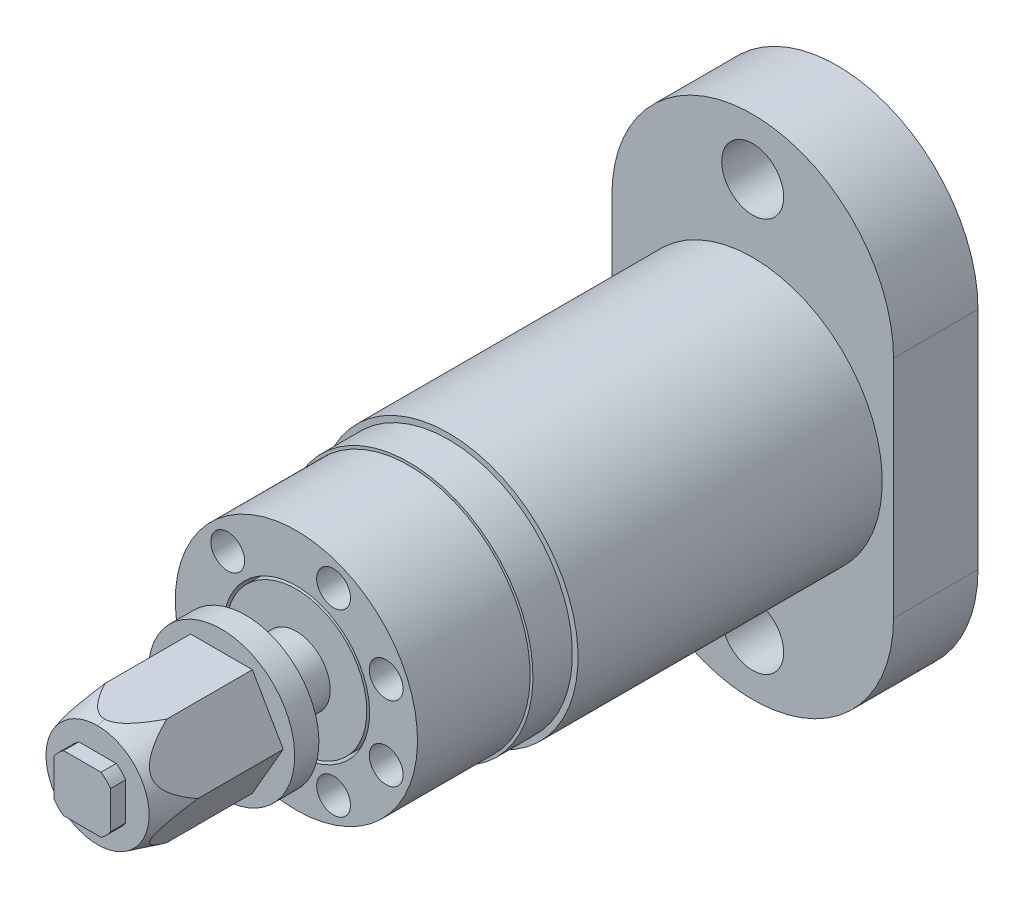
ISO-10303-21;
HEADER;
FILE_DESCRIPTION(('STEP AP214'),'2;1');
FILE_NAME('part.step','',(''),(''),'','','');
FILE_SCHEMA(('AUTOMOTIVE_DESIGN { 1 0 10303 214 1 1 1 1 }'));
ENDSEC;
DATA;
#1=APPLICATION_CONTEXT('core data for automotive mechanical design processes');
#2=APPLICATION_PROTOCOL_DEFINITION('international standard','automotive_design',2000,#1);
#3=PRODUCT_CONTEXT('',#1,'mechanical');
#4=PRODUCT('Part','Part','',(#3));
#5=PRODUCT_RELATED_PRODUCT_CATEGORY('part','',(#4));
#6=PRODUCT_DEFINITION_FORMATION('','',#4);
#7=PRODUCT_DEFINITION_CONTEXT('part definition',#1,'design');
#8=PRODUCT_DEFINITION('design','',#6,#7);
#9=PRODUCT_DEFINITION_SHAPE('','',#8);
#10=(LENGTH_UNIT() NAMED_UNIT(*) SI_UNIT(.MILLI.,.METRE.));
#11=(NAMED_UNIT(*) PLANE_ANGLE_UNIT() SI_UNIT($,.RADIAN.));
#12=(NAMED_UNIT(*) SI_UNIT($,.STERADIAN.) SOLID_ANGLE_UNIT());
#13=UNCERTAINTY_MEASURE_WITH_UNIT(LENGTH_MEASURE(1.E-05),#10,'distance_accuracy_value','');
#14=(GEOMETRIC_REPRESENTATION_CONTEXT(3) GLOBAL_UNCERTAINTY_ASSIGNED_CONTEXT((#13)) GLOBAL_UNIT_ASSIGNED_CONTEXT((#10,
#11,#12)) REPRESENTATION_CONTEXT('',''));
#15=CARTESIAN_POINT('',(0.,0.,0.));
#16=DIRECTION('',(0.,0.,1.));
#17=DIRECTION('',(1.,0.,0.));
#18=AXIS2_PLACEMENT_3D('',#15,#16,#17);
#19=CARTESIAN_POINT('',(0.,0.,96.));
#20=DIRECTION('',(0.,0.,-1.));
#21=DIRECTION('',(0.,-1.,0.));
#22=AXIS2_PLACEMENT_3D('',#19,#20,#21);
#23=CYLINDRICAL_SURFACE('',#22,12.5);
#24=CARTESIAN_POINT('',(0.,0.,84.));
#25=DIRECTION('',(0.,0.,-1.));
#26=DIRECTION('',(0.,-1.,0.));
#27=AXIS2_PLACEMENT_3D('',#24,#25,#26);
#28=CIRCLE('',#27,12.5);
#29=CARTESIAN_POINT('',(0.,-12.5,84.));
#30=VERTEX_POINT('',#29);
#31=EDGE_CURVE('E232',#30,#30,#28,.T.);
#32=ORIENTED_EDGE('',*,*,#31,.F.);
#33=EDGE_LOOP('',(#32));
#34=FACE_BOUND('',#33,.T.);
#35=CARTESIAN_POINT('',(0.,0.,96.));
#36=DIRECTION('',(0.,0.,-1.));
#37=DIRECTION('',(0.,-1.,0.));
#38=AXIS2_PLACEMENT_3D('',#35,#36,#37);
#39=CIRCLE('',#38,12.5);
#40=CARTESIAN_POINT('',(0.,-12.5,96.));
#41=VERTEX_POINT('',#40);
#42=EDGE_CURVE('E251',#41,#41,#39,.F.);
#43=ORIENTED_EDGE('',*,*,#42,.F.);
#44=EDGE_LOOP('',(#43));
#45=FACE_BOUND('',#44,.T.);
#46=ADVANCED_FACE('F14',(#34,#45),#23,.T.);
#47=CARTESIAN_POINT('',(12.65,-12.65,96.));
#48=DIRECTION('',(0.,0.,1.));
#49=DIRECTION('',(0.,1.,0.));
#50=AXIS2_PLACEMENT_3D('',#47,#48,#49);
#51=PLANE('',#50);
#52=CARTESIAN_POINT('',(0.,0.,96.));
#53=DIRECTION('',(0.,0.,-1.));
#54=DIRECTION('',(0.,-1.,0.));
#55=AXIS2_PLACEMENT_3D('',#52,#53,#54);
#56=CIRCLE('',#55,6.);
#57=CARTESIAN_POINT('',(0.,-6.,96.));
#58=VERTEX_POINT('',#57);
#59=EDGE_CURVE('E573',#58,#58,#56,.T.);
#60=ORIENTED_EDGE('',*,*,#59,.T.);
#61=EDGE_LOOP('',(#60));
#62=FACE_BOUND('',#61,.T.);
#63=ORIENTED_EDGE('',*,*,#42,.T.);
#64=EDGE_LOOP('',(#63));
#65=FACE_BOUND('',#64,.T.);
#66=ADVANCED_FACE('F498',(#62,#65),#51,.T.);
#67=CARTESIAN_POINT('',(0.,0.,105.));
#68=DIRECTION('',(0.,0.,-1.));
#69=DIRECTION('',(0.,-1.,0.));
#70=AXIS2_PLACEMENT_3D('',#67,#68,#69);
#71=CYLINDRICAL_SURFACE('',#70,6.);
#72=ORIENTED_EDGE('',*,*,#59,.F.);
#73=EDGE_LOOP('',(#72));
#74=FACE_BOUND('',#73,.T.);
#75=CARTESIAN_POINT('',(0.,0.,105.));
#76=DIRECTION('',(0.,0.,-1.));
#77=DIRECTION('',(0.,-1.,0.));
#78=AXIS2_PLACEMENT_3D('',#75,#76,#77);
#79=CIRCLE('',#78,6.);
#80=CARTESIAN_POINT('',(0.,-6.,105.));
#81=VERTEX_POINT('',#80);
#82=EDGE_CURVE('E277',#81,#81,#79,.F.);
#83=ORIENTED_EDGE('',*,*,#82,.F.);
#84=EDGE_LOOP('',(#83));
#85=FACE_BOUND('',#84,.T.);
#86=ADVANCED_FACE('F380',(#74,#85),#71,.T.);
#87=CARTESIAN_POINT('',(13.156,13.156,105.));
#88=DIRECTION('',(0.,0.,-1.));
#89=DIRECTION('',(0.,-1.,0.));
#90=AXIS2_PLACEMENT_3D('',#87,#88,#89);
#91=PLANE('',#90);
#92=ORIENTED_EDGE('',*,*,#82,.T.);
#93=EDGE_LOOP('',(#92));
#94=FACE_BOUND('',#93,.T.);
#95=CARTESIAN_POINT('',(0.,0.,105.));
#96=DIRECTION('',(0.,0.,-1.));
#97=DIRECTION('',(0.,-1.,0.));
#98=AXIS2_PLACEMENT_3D('',#95,#96,#97);
#99=CIRCLE('',#98,13.);
#100=CARTESIAN_POINT('',(0.,-13.,105.));
#101=VERTEX_POINT('',#100);
#102=EDGE_CURVE('E285',#101,#101,#99,.T.);
#103=ORIENTED_EDGE('',*,*,#102,.T.);
#104=EDGE_LOOP('',(#103));
#105=FACE_BOUND('',#104,.T.);
#106=ADVANCED_FACE('F375',(#94,#105),#91,.T.);
#107=CARTESIAN_POINT('',(0.,0.,109.3));
#108=DIRECTION('',(0.,0.,-1.));
#109=DIRECTION('',(0.,-1.,0.));
#110=AXIS2_PLACEMENT_3D('',#107,#108,#109);
#111=CYLINDRICAL_SURFACE('',#110,13.);
#112=ORIENTED_EDGE('',*,*,#102,.F.);
#113=EDGE_LOOP('',(#112));
#114=FACE_BOUND('',#113,.T.);
#115=CARTESIAN_POINT('',(0.,0.,109.3));
#116=DIRECTION('',(0.,0.,-1.));
#117=DIRECTION('',(0.,-1.,0.));
#118=AXIS2_PLACEMENT_3D('',#115,#116,#117);
#119=CIRCLE('',#118,13.);
#120=CARTESIAN_POINT('',(0.,-13.,109.3));
#121=VERTEX_POINT('',#120);
#122=EDGE_CURVE('E245',#121,#121,#119,.F.);
#123=ORIENTED_EDGE('',*,*,#122,.F.);
#124=EDGE_LOOP('',(#123));
#125=FACE_BOUND('',#124,.T.);
#126=ADVANCED_FACE('F379',(#114,#125),#111,.T.);
#127=CARTESIAN_POINT('',(-13.156,13.156,109.3));
#128=DIRECTION('',(0.,0.,1.));
#129=DIRECTION('',(0.,-1.,0.));
#130=AXIS2_PLACEMENT_3D('',#127,#128,#129);
#131=PLANE('',#130);
#132=DIRECTION('',(0.500000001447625,0.866025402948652,0.));
#133=VECTOR('',#132,1.);
#134=CARTESIAN_POINT('',(-10.969655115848,0.,109.3));
#135=LINE('',#134,#133);
#136=CARTESIAN_POINT('',(-10.969655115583,9.18015663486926E-11,109.3));
#137=VERTEX_POINT('',#136);
#138=CARTESIAN_POINT('',(-5.484827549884,9.499999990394,109.3));
#139=VERTEX_POINT('',#138);
#140=EDGE_CURVE('E286',#137,#139,#135,.T.);
#141=ORIENTED_EDGE('',*,*,#140,.T.);
#142=DIRECTION('',(1.,0.,0.));
#143=VECTOR('',#142,1.);
#144=CARTESIAN_POINT('',(0.,9.499999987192,109.3));
#145=LINE('',#144,#143);
#146=CARTESIAN_POINT('',(5.484827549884,9.499999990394,109.3));
#147=VERTEX_POINT('',#146);
#148=EDGE_CURVE('E282',#139,#147,#145,.T.);
#149=ORIENTED_EDGE('',*,*,#148,.T.);
#150=DIRECTION('',(0.500000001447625,-0.866025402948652,0.));
#151=VECTOR('',#150,1.);
#152=CARTESIAN_POINT('',(5.484827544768,9.499999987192,109.3));
#153=LINE('',#152,#151);
#154=CARTESIAN_POINT('',(10.969655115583,9.18015663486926E-11,109.3));
#155=VERTEX_POINT('',#154);
#156=EDGE_CURVE('E344',#147,#155,#153,.T.);
#157=ORIENTED_EDGE('',*,*,#156,.T.);
#158=DIRECTION('',(-0.500000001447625,-0.866025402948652,0.));
#159=VECTOR('',#158,1.);
#160=CARTESIAN_POINT('',(10.969655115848,0.,109.3));
#161=LINE('',#160,#159);
#162=CARTESIAN_POINT('',(5.48482754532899,-9.49999999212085,109.3));
#163=VERTEX_POINT('',#162);
#164=EDGE_CURVE('E296',#155,#163,#161,.T.);
#165=ORIENTED_EDGE('',*,*,#164,.T.);
#166=DIRECTION('',(-1.,0.,0.));
#167=VECTOR('',#166,1.);
#168=CARTESIAN_POINT('',(0.,-9.49999998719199,109.3));
#169=LINE('',#168,#167);
#170=CARTESIAN_POINT('',(-5.484827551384,-9.499999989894,109.3));
#171=VERTEX_POINT('',#170);
#172=EDGE_CURVE('E292',#163,#171,#169,.T.);
#173=ORIENTED_EDGE('',*,*,#172,.T.);
#174=DIRECTION('',(-0.500000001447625,0.866025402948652,0.));
#175=VECTOR('',#174,1.);
#176=CARTESIAN_POINT('',(-5.484827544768,-9.49999998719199,109.3));
#177=LINE('',#176,#175);
#178=EDGE_CURVE('E295',#171,#137,#177,.T.);
#179=ORIENTED_EDGE('',*,*,#178,.T.);
#180=EDGE_LOOP('',(#141,#149,#157,#165,#173,#179));
#181=FACE_BOUND('',#180,.T.);
#182=ORIENTED_EDGE('',*,*,#122,.T.);
#183=EDGE_LOOP('',(#182));
#184=FACE_BOUND('',#183,.T.);
#185=ADVANCED_FACE('F382',(#181,#184),#131,.T.);
#186=CARTESIAN_POINT('',(-10.969655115,0.,109.3));
#187=DIRECTION('',(0.866025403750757,-0.500000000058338,0.));
#188=DIRECTION('',(0.500000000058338,0.866025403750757,0.));
#189=AXIS2_PLACEMENT_3D('',#186,#187,#188);
#190=PLANE('',#189);
#191=DIRECTION('',(0.,0.,-1.));
#192=VECTOR('',#191,1.);
#193=CARTESIAN_POINT('',(-10.969655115,0.,119.719635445));
#194=LINE('',#193,#192);
#195=CARTESIAN_POINT('',(-10.969655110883,0.,124.512651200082));
#196=VERTEX_POINT('',#195);
#197=EDGE_CURVE('E273',#196,#137,#194,.T.);
#198=ORIENTED_EDGE('',*,*,#197,.F.);
#199=CARTESIAN_POINT('',(-5.4848275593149,9.4999999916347,124.512651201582));
#200=CARTESIAN_POINT('',(-5.52145977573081,9.4365511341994,124.649356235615));
#201=CARTESIAN_POINT('',(-5.55851559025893,9.37236858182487,124.785606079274));
#202=CARTESIAN_POINT('',(-5.63357253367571,9.24236614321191,125.057074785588));
#203=CARTESIAN_POINT('',(-5.67157374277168,9.17654611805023,125.192293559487));
#204=CARTESIAN_POINT('',(-5.78727189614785,8.97615103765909,125.596672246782));
#205=CARTESIAN_POINT('',(-5.86653215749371,8.83886823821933,125.864061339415));
#206=CARTESIAN_POINT('',(-6.0311679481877,8.55371068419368,126.395617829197));
#207=CARTESIAN_POINT('',(-6.11660476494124,8.40572977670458,126.659709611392));
#208=CARTESIAN_POINT('',(-6.29411370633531,8.09827527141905,127.17866387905));
#209=CARTESIAN_POINT('',(-6.38618046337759,7.93881097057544,127.433533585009));
#210=CARTESIAN_POINT('',(-6.52810211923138,7.69299545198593,127.798719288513));
#211=CARTESIAN_POINT('',(-6.57457424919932,7.61250336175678,127.914297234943));
#212=CARTESIAN_POINT('',(-6.66975857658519,7.44763927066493,128.141744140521));
#213=CARTESIAN_POINT('',(-6.71847103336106,7.36326682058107,128.253612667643));
#214=CARTESIAN_POINT('',(-6.81842359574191,7.19014390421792,128.472640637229));
#215=CARTESIAN_POINT('',(-6.86966206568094,7.10139627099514,128.579803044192));
#216=CARTESIAN_POINT('',(-6.97505888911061,6.91884361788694,128.788187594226));
#217=CARTESIAN_POINT('',(-7.02921663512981,6.82503965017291,128.889410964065));
#218=CARTESIAN_POINT('',(-7.17260616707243,6.57668169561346,129.139686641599));
#219=CARTESIAN_POINT('',(-7.26429122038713,6.41787852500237,129.283258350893));
#220=CARTESIAN_POINT('',(-7.45730915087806,6.08356166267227,129.541677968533));
#221=CARTESIAN_POINT('',(-7.55861279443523,5.90809860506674,129.656609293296));
#222=CARTESIAN_POINT('',(-7.73574280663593,5.60130042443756,129.812054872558));
#223=CARTESIAN_POINT('',(-7.80888606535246,5.47461258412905,129.86460847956));
#224=CARTESIAN_POINT('',(-7.9584904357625,5.21549021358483,129.945121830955));
#225=CARTESIAN_POINT('',(-8.03494700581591,5.0830635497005,129.97311418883));
#226=CARTESIAN_POINT('',(-8.18961632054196,4.8151684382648,130.001079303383));
#227=CARTESIAN_POINT('',(-8.2678365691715,4.67968699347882,130.00089214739));
#228=CARTESIAN_POINT('',(-8.42295199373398,4.41101919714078,129.972131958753));
#229=CARTESIAN_POINT('',(-8.49984633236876,4.27783429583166,129.943541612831));
#230=CARTESIAN_POINT('',(-8.66605082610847,3.98995966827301,129.852969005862));
#231=CARTESIAN_POINT('',(-8.75455689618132,3.83666265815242,129.785213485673));
#232=CARTESIAN_POINT('',(-8.9250673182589,3.54132994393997,129.622522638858));
#233=CARTESIAN_POINT('',(-9.00705628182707,3.3993208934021,129.527525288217));
#234=CARTESIAN_POINT('',(-9.15576970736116,3.14174168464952,129.330082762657));
#235=CARTESIAN_POINT('',(-9.22317727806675,3.0249883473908,129.229645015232));
#236=CARTESIAN_POINT('',(-9.35349094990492,2.79927844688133,129.017594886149));
#237=CARTESIAN_POINT('',(-9.41639294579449,2.69032899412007,128.905972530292));
#238=CARTESIAN_POINT('',(-9.53867240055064,2.47853476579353,128.673678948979));
#239=CARTESIAN_POINT('',(-9.59802197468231,2.3757382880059,128.552949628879));
#240=CARTESIAN_POINT('',(-9.71327233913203,2.17611880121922,128.305214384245));
#241=CARTESIAN_POINT('',(-9.76917450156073,2.07929341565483,128.178210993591));
#242=CARTESIAN_POINT('',(-9.88127894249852,1.88512282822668,127.911647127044));
#243=CARTESIAN_POINT('',(-9.93730300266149,1.78808630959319,127.771788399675));
#244=CARTESIAN_POINT('',(-10.0465628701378,1.5988426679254,127.487765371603));
#245=CARTESIAN_POINT('',(-10.0997981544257,1.50663645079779,127.343600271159));
#246=CARTESIAN_POINT('',(-10.2560588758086,1.23598494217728,126.905656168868));
#247=CARTESIAN_POINT('',(-10.3555016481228,1.06374500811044,126.606765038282));
#248=CARTESIAN_POINT('',(-10.5436251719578,0.737905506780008,126.011274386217));
#249=CARTESIAN_POINT('',(-10.6325683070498,0.583851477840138,125.715001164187));
#250=CARTESIAN_POINT('',(-10.7618983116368,0.35984533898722,125.266565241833));
#251=CARTESIAN_POINT('',(-10.8042613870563,0.286470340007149,125.116664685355));
#252=CARTESIAN_POINT('',(-10.8878082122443,0.14176299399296,124.815578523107));
#253=CARTESIAN_POINT('',(-10.9289921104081,0.0704303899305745,124.664393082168));
#254=CARTESIAN_POINT('',(-10.9696551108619,7.1673986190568E-09,124.512651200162));
#255=B_SPLINE_CURVE_WITH_KNOTS('',3,(#199,#200,#201,#202,#203,#204,#205,#206,#207,#208,#209,
#210,#211,#212,#213,#214,#215,#216,#217,#218,#219,#220,#221,#222,#223,#224,#225,#226,#227,#228,
#229,#230,#231,#232,#233,#234,#235,#236,#237,#238,#239,#240,#241,#242,#243,#244,#245,#246,#247,
#248,#249,#250,#251,#252,#253,#254),.UNSPECIFIED.,.F.,.F.,(4,2,2,2,2,2,2,2,2,2,2,2,2,2,2,2,2,2,
2,2,2,2,2,2,2,2,2,4),(0.,0.46529257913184,0.930624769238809,1.86296450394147,2.80634177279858,
3.74896368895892,4.19381456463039,4.63871707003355,5.08333517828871,5.5278611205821,
6.22481389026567,6.91971238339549,7.38431302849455,7.84829581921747,8.31491171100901,
8.78181220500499,9.34723824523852,9.91396200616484,10.417575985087,10.9216431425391,
11.4292537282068,11.936660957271,12.4741121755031,13.0116638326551,14.0880685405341,
15.1245428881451,15.6410886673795,16.1575691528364),.UNSPECIFIED.);
#256=CARTESIAN_POINT('',(-5.48482755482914,9.49999999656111,124.512651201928));
#257=VERTEX_POINT('',#256);
#258=EDGE_CURVE('E272',#257,#196,#255,.T.);
#259=ORIENTED_EDGE('',*,*,#258,.F.);
#260=DIRECTION('',(0.,0.,-1.));
#261=VECTOR('',#260,1.);
#262=CARTESIAN_POINT('',(-5.484827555,9.5,119.7108318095));
#263=LINE('',#262,#261);
#264=EDGE_CURVE('E33',#257,#139,#263,.T.);
#265=ORIENTED_EDGE('',*,*,#264,.T.);
#266=ORIENTED_EDGE('',*,*,#140,.F.);
#267=EDGE_LOOP('',(#198,#259,#265,#266));
#268=FACE_BOUND('',#267,.T.);
#269=ADVANCED_FACE('F371',(#268),#190,.F.);
#270=CARTESIAN_POINT('',(-5.484827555,9.5,109.3));
#271=DIRECTION('',(0.,-1.,0.));
#272=DIRECTION('',(1.,0.,0.));
#273=AXIS2_PLACEMENT_3D('',#270,#271,#272);
#274=PLANE('',#273);
#275=ORIENTED_EDGE('',*,*,#264,.F.);
#276=CARTESIAN_POINT('',(7.79392972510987E-10,9.49999999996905,129.997478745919));
#277=CARTESIAN_POINT('',(-0.085857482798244,9.4999999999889,129.997537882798));
#278=CARTESIAN_POINT('',(-0.171677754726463,9.49999999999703,129.993136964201));
#279=CARTESIAN_POINT('',(-0.342306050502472,9.50000000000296,129.975879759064));
#280=CARTESIAN_POINT('',(-0.42711568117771,9.50000000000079,129.963039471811));
#281=CARTESIAN_POINT('',(-0.593610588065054,9.49999999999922,129.929666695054));
#282=CARTESIAN_POINT('',(-0.675324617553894,9.49999999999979,129.909276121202));
#283=CARTESIAN_POINT('',(-0.836696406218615,9.50000000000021,129.86150303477));
#284=CARTESIAN_POINT('',(-0.91635309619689,9.50000000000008,129.834116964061));
#285=CARTESIAN_POINT('',(-1.20102014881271,9.49999999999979,129.723459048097));
#286=CARTESIAN_POINT('',(-1.39898039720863,9.49999999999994,129.621790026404));
#287=CARTESIAN_POINT('',(-1.7778418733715,9.50000000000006,129.388826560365));
#288=CARTESIAN_POINT('',(-1.95858802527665,9.50000000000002,129.257293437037));
#289=CARTESIAN_POINT('',(-2.34440974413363,9.49999999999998,128.942079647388));
#290=CARTESIAN_POINT('',(-2.54532836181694,9.49999999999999,128.75339142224));
#291=CARTESIAN_POINT('',(-2.92839408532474,9.50000000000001,128.357624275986));
#292=CARTESIAN_POINT('',(-3.11050332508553,9.5,128.150509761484));
#293=CARTESIAN_POINT('',(-3.46078975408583,9.5,127.723235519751));
#294=CARTESIAN_POINT('',(-3.62889365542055,9.5,127.503016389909));
#295=CARTESIAN_POINT('',(-3.95323144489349,9.5,127.054363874));
#296=CARTESIAN_POINT('',(-4.10947491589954,9.5,126.825937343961));
#297=CARTESIAN_POINT('',(-4.37209993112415,9.5,126.42480353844));
#298=CARTESIAN_POINT('',(-4.48065467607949,9.5,126.25350646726));
#299=CARTESIAN_POINT('',(-4.69343820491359,9.5,125.90821429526));
#300=CARTESIAN_POINT('',(-4.7976663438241,9.5,125.734218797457));
#301=CARTESIAN_POINT('',(-5.00086150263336,9.5,125.386597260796));
#302=CARTESIAN_POINT('',(-5.09988318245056,9.5,125.213003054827));
#303=CARTESIAN_POINT('',(-5.29467604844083,9.5,124.864067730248));
#304=CARTESIAN_POINT('',(-5.39044821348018,9.5,124.688727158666));
#305=CARTESIAN_POINT('',(-5.48482754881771,9.5,124.51265120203));
#306=B_SPLINE_CURVE_WITH_KNOTS('',3,(#276,#277,#278,#279,#280,#281,#282,#283,#284,#285,#286,
#287,#288,#289,#290,#291,#292,#293,#294,#295,#296,#297,#298,#299,#300,#301,#302,#303,#304,#305),
.UNSPECIFIED.,.F.,.F.,(4,2,2,2,2,2,2,2,2,2,2,2,2,2,4),(0.,0.257400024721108,0.51431347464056,
0.766624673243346,1.01906446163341,1.68248578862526,2.35140857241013,3.17633740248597,
4.00289583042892,4.83353847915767,5.66350268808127,6.27182955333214,6.8802467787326,
7.47976329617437,8.0790975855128),.UNSPECIFIED.);
#307=CARTESIAN_POINT('',(2.33817926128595E-09,9.49999999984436,129.9974787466));
#308=VERTEX_POINT('',#307);
#309=EDGE_CURVE('E278',#308,#257,#306,.T.);
#310=ORIENTED_EDGE('',*,*,#309,.F.);
#311=CARTESIAN_POINT('',(5.48482754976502,9.5000000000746,124.512651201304));
#312=CARTESIAN_POINT('',(5.41119706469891,9.5000000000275,124.650039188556));
#313=CARTESIAN_POINT('',(5.33671097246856,9.50000000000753,124.786967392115));
#314=CARTESIAN_POINT('',(5.18582820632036,9.49999999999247,125.05978189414));
#315=CARTESIAN_POINT('',(5.10943136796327,9.49999999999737,125.195668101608));
#316=CARTESIAN_POINT('',(4.87681702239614,9.50000000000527,125.602030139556));
#317=CARTESIAN_POINT('',(4.71743850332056,9.50000000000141,125.870715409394));
#318=CARTESIAN_POINT('',(4.38795911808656,9.49999999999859,126.402141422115));
#319=CARTESIAN_POINT('',(4.21783902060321,9.49999999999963,126.664870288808));
#320=CARTESIAN_POINT('',(3.86443940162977,9.50000000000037,127.181174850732));
#321=CARTESIAN_POINT('',(3.68117039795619,9.50000000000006,127.434757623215));
#322=CARTESIAN_POINT('',(3.40401283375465,9.49999999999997,127.791341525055));
#323=CARTESIAN_POINT('',(3.31703980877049,9.49999999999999,127.899724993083));
#324=CARTESIAN_POINT('',(3.13919781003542,9.50000000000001,128.11327235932));
#325=CARTESIAN_POINT('',(3.04832861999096,9.5,128.218436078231));
#326=CARTESIAN_POINT('',(2.8617271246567,9.5,128.425294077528));
#327=CARTESIAN_POINT('',(2.76597363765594,9.5,128.526969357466));
#328=CARTESIAN_POINT('',(2.56941118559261,9.5,128.725298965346));
#329=CARTESIAN_POINT('',(2.4686028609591,9.5,128.821953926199));
#330=CARTESIAN_POINT('',(2.2592555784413,9.5,129.010678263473));
#331=CARTESIAN_POINT('',(2.15060779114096,9.5,129.102629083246));
#332=CARTESIAN_POINT('',(1.92669697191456,9.5,129.277990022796));
#333=CARTESIAN_POINT('',(1.81143156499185,9.5,129.361397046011));
#334=CARTESIAN_POINT('',(1.45693658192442,9.5,129.59332332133));
#335=CARTESIAN_POINT('',(1.20625018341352,9.5,129.7261988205));
#336=CARTESIAN_POINT('',(0.868064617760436,9.5,129.850859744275));
#337=CARTESIAN_POINT('',(0.792347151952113,9.5,129.875519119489));
#338=CARTESIAN_POINT('',(0.639135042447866,9.5,129.918473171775));
#339=CARTESIAN_POINT('',(0.561641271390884,9.5,129.936770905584));
#340=CARTESIAN_POINT('',(0.40390630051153,9.5,129.966684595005));
#341=CARTESIAN_POINT('',(0.323640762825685,9.5,129.978173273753));
#342=CARTESIAN_POINT('',(0.162260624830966,9.5,129.993600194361));
#343=CARTESIAN_POINT('',(0.0811448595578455,9.5,129.997526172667));
#344=CARTESIAN_POINT('',(7.82089266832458E-10,9.5,129.997478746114));
#345=B_SPLINE_CURVE_WITH_KNOTS('',3,(#311,#312,#313,#314,#315,#316,#317,#318,#319,#320,#321,
#322,#323,#324,#325,#326,#327,#328,#329,#330,#331,#332,#333,#334,#335,#336,#337,#338,#339,#340,
#341,#342,#343,#344),.UNSPECIFIED.,.F.,.F.,(4,2,2,2,2,2,2,2,2,2,2,2,2,2,2,2,4),(0.,
0.467616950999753,0.935274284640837,1.87226695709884,2.81098756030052,3.74896547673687,
4.16578848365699,4.58263466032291,5.00147463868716,5.4202616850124,5.84682926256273,
6.27355089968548,7.11562236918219,7.35430705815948,7.59287690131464,7.83577597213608,
8.07906859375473),.UNSPECIFIED.);
#346=CARTESIAN_POINT('',(5.48482755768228,9.49999999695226,124.512651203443));
#347=VERTEX_POINT('',#346);
#348=EDGE_CURVE('E281',#347,#308,#345,.T.);
#349=ORIENTED_EDGE('',*,*,#348,.F.);
#350=DIRECTION('',(0.,0.,1.));
#351=VECTOR('',#350,1.);
#352=CARTESIAN_POINT('',(5.484827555,9.5,119.7108318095));
#353=LINE('',#352,#351);
#354=EDGE_CURVE('E275',#147,#347,#353,.T.);
#355=ORIENTED_EDGE('',*,*,#354,.F.);
#356=ORIENTED_EDGE('',*,*,#148,.F.);
#357=EDGE_LOOP('',(#275,#310,#349,#355,#356));
#358=FACE_BOUND('',#357,.T.);
#359=ADVANCED_FACE('F365',(#358),#274,.F.);
#360=CARTESIAN_POINT('',(5.484827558,9.499999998,109.3));
#361=DIRECTION('',(-0.866025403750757,-0.500000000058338,0.));
#362=DIRECTION('',(0.500000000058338,-0.866025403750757,0.));
#363=AXIS2_PLACEMENT_3D('',#360,#361,#362);
#364=PLANE('',#363);
#365=ORIENTED_EDGE('',*,*,#354,.T.);
#366=CARTESIAN_POINT('',(10.9696551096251,6.37260383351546E-09,124.512651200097));
#367=CARTESIAN_POINT('',(10.9330228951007,0.0634488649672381,124.649356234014));
#368=CARTESIAN_POINT('',(10.8959670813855,0.127631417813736,124.785606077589));
#369=CARTESIAN_POINT('',(10.8209101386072,0.257633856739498,125.057074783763));
#370=CARTESIAN_POINT('',(10.7829089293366,0.323453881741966,125.192293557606));
#371=CARTESIAN_POINT('',(10.66721077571,0.523848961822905,125.596672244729));
#372=CARTESIAN_POINT('',(10.5879505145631,0.661131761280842,125.86406133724));
#373=CARTESIAN_POINT('',(10.423314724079,0.946289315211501,126.395617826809));
#374=CARTESIAN_POINT('',(10.3378779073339,1.09427022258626,126.659709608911));
#375=CARTESIAN_POINT('',(10.1603689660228,1.40172472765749,127.178663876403));
#376=CARTESIAN_POINT('',(10.068302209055,1.56118902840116,127.433533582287));
#377=CARTESIAN_POINT('',(9.92638055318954,1.80700454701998,127.798719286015));
#378=CARTESIAN_POINT('',(9.87990842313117,1.88749663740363,127.914297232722));
#379=CARTESIAN_POINT('',(9.78472409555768,2.05236072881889,128.141744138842));
#380=CARTESIAN_POINT('',(9.73601163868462,2.13673317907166,128.253612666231));
#381=CARTESIAN_POINT('',(9.63605907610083,2.30985609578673,128.472640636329));
#382=CARTESIAN_POINT('',(9.58482060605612,2.39860372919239,128.579803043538));
#383=CARTESIAN_POINT('',(9.47942378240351,2.58115638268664,128.788187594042));
#384=CARTESIAN_POINT('',(9.42526603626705,2.67496035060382,128.889410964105));
#385=CARTESIAN_POINT('',(9.28187650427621,2.92331830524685,129.139686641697));
#386=CARTESIAN_POINT('',(9.19019145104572,3.08212147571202,129.283258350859));
#387=CARTESIAN_POINT('',(8.99717352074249,3.416438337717,129.541677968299));
#388=CARTESIAN_POINT('',(8.89586987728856,3.59190139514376,129.656609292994));
#389=CARTESIAN_POINT('',(8.71873986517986,3.89869957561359,129.81205487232));
#390=CARTESIAN_POINT('',(8.64559660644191,4.02538741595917,129.864608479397));
#391=CARTESIAN_POINT('',(8.49599223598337,4.28450978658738,129.945121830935));
#392=CARTESIAN_POINT('',(8.41953566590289,4.41693645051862,129.973114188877));
#393=CARTESIAN_POINT('',(8.26486635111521,4.68483156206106,130.001079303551));
#394=CARTESIAN_POINT('',(8.18664610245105,4.82031300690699,130.000892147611));
#395=CARTESIAN_POINT('',(8.03153067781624,5.08898080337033,129.972131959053));
#396=CARTESIAN_POINT('',(7.95463633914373,5.22216570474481,129.943541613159));
#397=CARTESIAN_POINT('',(7.78843184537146,5.51004033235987,129.852969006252));
#398=CARTESIAN_POINT('',(7.69992577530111,5.66333734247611,129.785213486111));
#399=CARTESIAN_POINT('',(7.52941535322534,5.95867005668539,129.62252263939));
#400=CARTESIAN_POINT('',(7.44742638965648,6.10067910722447,129.527525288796));
#401=CARTESIAN_POINT('',(7.29871296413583,6.35825831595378,129.330082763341));
#402=CARTESIAN_POINT('',(7.23130539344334,6.4750116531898,129.229645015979));
#403=CARTESIAN_POINT('',(7.10099172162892,6.70072155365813,129.017594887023));
#404=CARTESIAN_POINT('',(7.03808972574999,6.80967100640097,128.90597253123));
#405=CARTESIAN_POINT('',(6.91581027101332,7.02146523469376,128.673678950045));
#406=CARTESIAN_POINT('',(6.8564606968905,7.12426171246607,128.552949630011));
#407=CARTESIAN_POINT('',(6.74121033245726,7.32388119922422,128.305214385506));
#408=CARTESIAN_POINT('',(6.6853081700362,7.4207065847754,128.178210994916));
#409=CARTESIAN_POINT('',(6.57320372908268,7.6148771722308,127.911647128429));
#410=CARTESIAN_POINT('',(6.51717966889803,7.71191369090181,127.771788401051));
#411=CARTESIAN_POINT('',(6.40791980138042,7.9011573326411,127.487765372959));
#412=CARTESIAN_POINT('',(6.35468451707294,7.99336354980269,127.343600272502));
#413=CARTESIAN_POINT('',(6.19842379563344,8.26401505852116,126.905656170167));
#414=CARTESIAN_POINT('',(6.09898102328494,8.43625499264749,126.606765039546));
#415=CARTESIAN_POINT('',(5.91085749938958,8.76209449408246,126.011274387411));
#416=CARTESIAN_POINT('',(5.82191436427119,8.916148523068,125.715001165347));
#417=CARTESIAN_POINT('',(5.69258435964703,9.14015466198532,125.266565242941));
#418=CARTESIAN_POINT('',(5.65022128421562,9.21352966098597,125.116664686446));
#419=CARTESIAN_POINT('',(5.56667445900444,9.3582370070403,124.815578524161));
#420=CARTESIAN_POINT('',(5.52549056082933,9.42956961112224,124.664393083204));
#421=CARTESIAN_POINT('',(5.4848275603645,9.49999999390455,124.512651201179));
#422=B_SPLINE_CURVE_WITH_KNOTS('',3,(#366,#367,#368,#369,#370,#371,#372,#373,#374,#375,#376,
#377,#378,#379,#380,#381,#382,#383,#384,#385,#386,#387,#388,#389,#390,#391,#392,#393,#394,#395,
#396,#397,#398,#399,#400,#401,#402,#403,#404,#405,#406,#407,#408,#409,#410,#411,#412,#413,#414,
#415,#416,#417,#418,#419,#420,#421),.UNSPECIFIED.,.F.,.F.,(4,2,2,2,2,2,2,2,2,2,2,2,2,2,2,2,2,2,
2,2,2,2,2,2,2,2,2,4),(0.,0.465292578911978,0.93062476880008,1.86296450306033,2.80634177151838,
3.74896368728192,4.19381456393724,4.63871707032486,5.08333517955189,5.52786112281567,
6.22481389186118,6.91971238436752,7.38431302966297,7.84829582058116,8.31491171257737,
8.78181220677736,9.34723824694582,9.91396200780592,10.4175759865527,10.921643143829,
11.429253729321,11.9366609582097,12.4741121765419,13.0116638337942,14.0880685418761,
15.1245428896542,15.6410886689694,16.157569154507),.UNSPECIFIED.);
#423=CARTESIAN_POINT('',(10.96965511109,0.,124.512651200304));
#424=VERTEX_POINT('',#423);
#425=EDGE_CURVE('E507',#424,#347,#422,.T.);
#426=ORIENTED_EDGE('',*,*,#425,.F.);
#427=DIRECTION('',(0.,0.,-1.));
#428=VECTOR('',#427,1.);
#429=CARTESIAN_POINT('',(10.969655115,0.,119.719635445));
#430=LINE('',#429,#428);
#431=EDGE_CURVE('E262',#424,#155,#430,.T.);
#432=ORIENTED_EDGE('',*,*,#431,.T.);
#433=ORIENTED_EDGE('',*,*,#156,.F.);
#434=EDGE_LOOP('',(#365,#426,#432,#433));
#435=FACE_BOUND('',#434,.T.);
#436=ADVANCED_FACE('F370',(#435),#364,.F.);
#437=CARTESIAN_POINT('',(10.969655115,0.,109.3));
#438=DIRECTION('',(-0.866025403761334,0.500000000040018,0.));
#439=DIRECTION('',(-0.500000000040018,-0.866025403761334,0.));
#440=AXIS2_PLACEMENT_3D('',#437,#438,#439);
#441=PLANE('',#440);
#442=ORIENTED_EDGE('',*,*,#431,.F.);
#443=CARTESIAN_POINT('',(5.48482755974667,-9.49999999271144,124.512651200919));
#444=CARTESIAN_POINT('',(5.5214597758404,-9.43655113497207,124.649356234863));
#445=CARTESIAN_POINT('',(5.55851559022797,-9.37236858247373,124.78560607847));
#446=CARTESIAN_POINT('',(5.63357253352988,-9.24236614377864,125.057074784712));
#447=CARTESIAN_POINT('',(5.67157374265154,-9.17654611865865,125.192293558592));
#448=CARTESIAN_POINT('',(5.78727189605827,-8.97615103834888,125.596672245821));
#449=CARTESIAN_POINT('',(5.86653215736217,-8.83886823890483,125.8640613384));
#450=CARTESIAN_POINT('',(6.03116794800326,-8.55371068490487,126.39561782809));
#451=CARTESIAN_POINT('',(6.11660476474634,-8.40572977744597,126.659709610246));
#452=CARTESIAN_POINT('',(6.29411370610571,-8.09827527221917,127.178663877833));
#453=CARTESIAN_POINT('',(6.38618046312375,-7.9388109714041,127.433533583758));
#454=CARTESIAN_POINT('',(6.5281021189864,-7.69299545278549,127.798719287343));
#455=CARTESIAN_POINT('',(6.57457424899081,-7.61250336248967,127.91429723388));
#456=CARTESIAN_POINT('',(6.66975857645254,-7.44763927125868,128.141744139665));
#457=CARTESIAN_POINT('',(6.7184710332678,-7.36326682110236,128.25361266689));
#458=CARTESIAN_POINT('',(6.81842359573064,-7.19014390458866,128.472640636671));
#459=CARTESIAN_POINT('',(6.86966206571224,-7.10139627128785,128.579803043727));
#460=CARTESIAN_POINT('',(6.97505888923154,-6.91884361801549,128.788187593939));
#461=CARTESIAN_POINT('',(7.02921663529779,-6.82503965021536,128.889410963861));
#462=CARTESIAN_POINT('',(7.17260616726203,-6.57668169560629,129.139686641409));
#463=CARTESIAN_POINT('',(7.26429122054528,-6.41787852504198,129.283258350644));
#464=CARTESIAN_POINT('',(7.45730915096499,-6.08356166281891,129.541677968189));
#465=CARTESIAN_POINT('',(7.5586127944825,-5.90809860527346,129.656609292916));
#466=CARTESIAN_POINT('',(7.73574280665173,-5.6013004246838,129.812054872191));
#467=CARTESIAN_POINT('',(7.80888606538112,-5.47461258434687,129.864608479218));
#468=CARTESIAN_POINT('',(7.95849043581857,-5.21549021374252,129.945121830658));
#469=CARTESIAN_POINT('',(8.03494700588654,-5.0830635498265,129.973114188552));
#470=CARTESIAN_POINT('',(8.18961632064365,-4.81516843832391,130.001079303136));
#471=CARTESIAN_POINT('',(8.26783656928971,-4.67968699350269,130.000892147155));
#472=CARTESIAN_POINT('',(8.42295199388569,-4.4110191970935,129.97213195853));
#473=CARTESIAN_POINT('',(8.49984633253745,-4.27783429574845,129.943541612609));
#474=CARTESIAN_POINT('',(8.66605082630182,-3.98995966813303,129.852969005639));
#475=CARTESIAN_POINT('',(8.75455689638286,-3.83666265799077,129.78521348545));
#476=CARTESIAN_POINT('',(8.92506731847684,-3.5413299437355,129.62252263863));
#477=CARTESIAN_POINT('',(9.00705628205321,-3.39932089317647,129.527525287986));
#478=CARTESIAN_POINT('',(9.15576970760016,-3.14174168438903,129.330082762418));
#479=CARTESIAN_POINT('',(9.22317727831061,-3.02498834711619,129.229645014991));
#480=CARTESIAN_POINT('',(9.35349095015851,-2.79927844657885,129.017594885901));
#481=CARTESIAN_POINT('',(9.41639294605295,-2.69032899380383,128.90597253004));
#482=CARTESIAN_POINT('',(9.53867240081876,-2.47853476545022,128.673678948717));
#483=CARTESIAN_POINT('',(9.59802197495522,-2.37573828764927,128.552949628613));
#484=CARTESIAN_POINT('',(9.71327233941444,-2.17611880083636,128.305214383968));
#485=CARTESIAN_POINT('',(9.76917450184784,-2.07929341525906,128.178210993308));
#486=CARTESIAN_POINT('',(9.88127894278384,-1.88512282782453,127.911647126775));
#487=CARTESIAN_POINT('',(9.93730300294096,-1.78808630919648,127.771788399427));
#488=CARTESIAN_POINT('',(10.0465628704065,-1.59884266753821,127.487765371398));
#489=CARTESIAN_POINT('',(10.0997981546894,-1.50663645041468,127.343600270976));
#490=CARTESIAN_POINT('',(10.2560588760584,-1.23598494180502,126.905656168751));
#491=CARTESIAN_POINT('',(10.3555016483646,-1.0637450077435,126.606765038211));
#492=CARTESIAN_POINT('',(10.5436251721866,-0.737905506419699,126.011274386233));
#493=CARTESIAN_POINT('',(10.6325683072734,-0.583851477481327,125.715001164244));
#494=CARTESIAN_POINT('',(10.7618983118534,-0.359845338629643,125.266565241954));
#495=CARTESIAN_POINT('',(10.8042613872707,-0.286470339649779,125.116664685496));
#496=CARTESIAN_POINT('',(10.8878082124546,-0.141762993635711,124.815578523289));
#497=CARTESIAN_POINT('',(10.9289921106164,-0.0704303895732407,124.664393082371));
#498=CARTESIAN_POINT('',(10.9696551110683,-6.80985129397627E-09,124.512651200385));
#499=B_SPLINE_CURVE_WITH_KNOTS('',3,(#443,#444,#445,#446,#447,#448,#449,#450,#451,#452,#453,
#454,#455,#456,#457,#458,#459,#460,#461,#462,#463,#464,#465,#466,#467,#468,#469,#470,#471,#472,
#473,#474,#475,#476,#477,#478,#479,#480,#481,#482,#483,#484,#485,#486,#487,#488,#489,#490,#491,
#492,#493,#494,#495,#496,#497,#498),.UNSPECIFIED.,.F.,.F.,(4,2,2,2,2,2,2,2,2,2,2,2,2,2,2,2,2,2,
2,2,2,2,2,2,2,2,2,4),(0.,0.465292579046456,0.930624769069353,1.86296450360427,2.80634177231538,
3.74896368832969,4.19381456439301,4.63871707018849,5.08333517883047,5.52786112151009,
6.22481389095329,6.91971238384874,7.38431302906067,7.84829581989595,8.31491171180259,
8.78181220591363,9.34723824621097,9.9139620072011,10.4175759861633,10.9216431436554,
11.4292537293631,11.9366609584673,12.4741121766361,13.0116638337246,14.0880685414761,
15.1245428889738,15.6410886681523,16.1575691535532),.UNSPECIFIED.);
#500=CARTESIAN_POINT('',(5.48482755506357,-9.49999999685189,124.512651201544));
#501=VERTEX_POINT('',#500);
#502=EDGE_CURVE('E265',#501,#424,#499,.T.);
#503=ORIENTED_EDGE('',*,*,#502,.F.);
#504=DIRECTION('',(0.,0.,-1.));
#505=VECTOR('',#504,1.);
#506=CARTESIAN_POINT('',(5.484827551,-9.5,119.7108318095));
#507=LINE('',#506,#505);
#508=EDGE_CURVE('E266',#501,#163,#507,.T.);
#509=ORIENTED_EDGE('',*,*,#508,.T.);
#510=ORIENTED_EDGE('',*,*,#164,.F.);
#511=EDGE_LOOP('',(#442,#503,#509,#510));
#512=FACE_BOUND('',#511,.T.);
#513=ADVANCED_FACE('F537',(#512),#441,.F.);
#514=CARTESIAN_POINT('',(5.484827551,-9.5,109.3));
#515=DIRECTION('',(0.,1.,0.));
#516=DIRECTION('',(-1.,0.,0.));
#517=AXIS2_PLACEMENT_3D('',#514,#515,#516);
#518=PLANE('',#517);
#519=ORIENTED_EDGE('',*,*,#508,.F.);
#520=CARTESIAN_POINT('',(-9.99999037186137E-10,-9.49999999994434,129.997478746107));
#521=CARTESIAN_POINT('',(0.0858574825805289,-9.49999999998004,129.997537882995));
#522=CARTESIAN_POINT('',(0.171677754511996,-9.49999999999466,129.993136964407));
#523=CARTESIAN_POINT('',(0.342306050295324,-9.50000000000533,129.975879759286));
#524=CARTESIAN_POINT('',(0.427115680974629,-9.50000000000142,129.963039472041));
#525=CARTESIAN_POINT('',(0.593610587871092,-9.49999999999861,129.9296666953));
#526=CARTESIAN_POINT('',(0.675324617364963,-9.49999999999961,129.909276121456));
#527=CARTESIAN_POINT('',(0.836696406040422,-9.50000000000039,129.861503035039));
#528=CARTESIAN_POINT('',(0.916353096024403,-9.50000000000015,129.834116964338));
#529=CARTESIAN_POINT('',(1.20102014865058,-9.49999999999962,129.723459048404));
#530=CARTESIAN_POINT('',(1.39898039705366,-9.4999999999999,129.621790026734));
#531=CARTESIAN_POINT('',(1.77784187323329,-9.5000000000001,129.388826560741));
#532=CARTESIAN_POINT('',(1.95858802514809,-9.50000000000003,129.257293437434));
#533=CARTESIAN_POINT('',(2.3444097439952,-9.49999999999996,128.942079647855));
#534=CARTESIAN_POINT('',(2.54532836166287,-9.49999999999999,128.753391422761));
#535=CARTESIAN_POINT('',(2.92839408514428,-9.50000000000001,128.357624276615));
#536=CARTESIAN_POINT('',(3.11050332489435,-9.5,128.150509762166));
#537=CARTESIAN_POINT('',(3.46078975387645,-9.5,127.723235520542));
#538=CARTESIAN_POINT('',(3.6288936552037,-9.5,127.503016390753));
#539=CARTESIAN_POINT('',(3.95323144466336,-9.5,127.054363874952));
#540=CARTESIAN_POINT('',(4.10947491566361,-9.5,126.825937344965));
#541=CARTESIAN_POINT('',(4.37209993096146,-9.5,126.42480353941));
#542=CARTESIAN_POINT('',(4.48065467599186,-9.5,126.253506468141));
#543=CARTESIAN_POINT('',(4.69343820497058,-9.5,125.908214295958));
#544=CARTESIAN_POINT('',(4.79766634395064,-9.5,125.734218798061));
#545=CARTESIAN_POINT('',(5.00086150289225,-9.5,125.386597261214));
#546=CARTESIAN_POINT('',(5.09988318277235,-9.5,125.213003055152));
#547=CARTESIAN_POINT('',(5.2946760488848,-9.5,124.864067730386));
#548=CARTESIAN_POINT('',(5.39044821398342,-9.5,124.688727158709));
#549=CARTESIAN_POINT('',(5.48482754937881,-9.5,124.512651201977));
#550=B_SPLINE_CURVE_WITH_KNOTS('',3,(#520,#521,#522,#523,#524,#525,#526,#527,#528,#529,#530,
#531,#532,#533,#534,#535,#536,#537,#538,#539,#540,#541,#542,#543,#544,#545,#546,#547,#548,#549),
.UNSPECIFIED.,.F.,.F.,(4,2,2,2,2,2,2,2,2,2,2,2,2,2,4),(0.,0.257400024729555,0.514313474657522,
0.76662467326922,1.0190644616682,1.682485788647,2.3514085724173,3.17633740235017,
4.00289583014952,4.83353847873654,5.66350268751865,6.27182955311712,6.8802467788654,
7.47976329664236,8.07909758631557),.UNSPECIFIED.);
#551=CARTESIAN_POINT('',(-4.99999314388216E-10,-9.49999999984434,129.997478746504));
#552=VERTEX_POINT('',#551);
#553=EDGE_CURVE('E269',#552,#501,#550,.T.);
#554=ORIENTED_EDGE('',*,*,#553,.F.);
#555=CARTESIAN_POINT('',(-5.48482754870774,-9.4999999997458,124.512651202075));
#556=CARTESIAN_POINT('',(-5.41119706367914,-9.4999999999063,124.650039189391));
#557=CARTESIAN_POINT('',(-5.33671097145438,-9.49999999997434,124.786967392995));
#558=CARTESIAN_POINT('',(-5.18582820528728,-9.50000000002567,125.059781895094));
#559=CARTESIAN_POINT('',(-5.10943136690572,-9.50000000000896,125.195668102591));
#560=CARTESIAN_POINT('',(-4.87681702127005,-9.49999999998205,125.602030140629));
#561=CARTESIAN_POINT('',(-4.71743850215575,-9.49999999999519,125.870715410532));
#562=CARTESIAN_POINT('',(-4.38795911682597,-9.50000000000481,126.402141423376));
#563=CARTESIAN_POINT('',(-4.21783901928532,-9.50000000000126,126.66487029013));
#564=CARTESIAN_POINT('',(-3.86443940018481,-9.49999999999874,127.181174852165));
#565=CARTESIAN_POINT('',(-3.68117039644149,-9.49999999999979,127.434757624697));
#566=CARTESIAN_POINT('',(-3.40401283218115,-9.5000000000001,127.791341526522));
#567=CARTESIAN_POINT('',(-3.31703980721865,-9.50000000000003,127.899724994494));
#568=CARTESIAN_POINT('',(-3.13919780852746,-9.49999999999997,128.113272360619));
#569=CARTESIAN_POINT('',(-3.04832861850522,-9.49999999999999,128.218436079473));
#570=CARTESIAN_POINT('',(-2.86172712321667,-9.50000000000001,128.425294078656));
#571=CARTESIAN_POINT('',(-2.76597363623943,-9.5,128.526969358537));
#572=CARTESIAN_POINT('',(-2.56941118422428,-9.5,128.725298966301));
#573=CARTESIAN_POINT('',(-2.46860285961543,-9.5,128.821953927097));
#574=CARTESIAN_POINT('',(-2.25925557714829,-9.5,129.010678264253));
#575=CARTESIAN_POINT('',(-2.15060778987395,-9.5,129.102629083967));
#576=CARTESIAN_POINT('',(-1.92669697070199,-9.5,129.277990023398));
#577=CARTESIAN_POINT('',(-1.81143156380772,-9.5,129.361397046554));
#578=CARTESIAN_POINT('',(-1.45693658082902,-9.5,129.593323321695));
#579=CARTESIAN_POINT('',(-1.20625018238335,-9.5,129.726198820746));
#580=CARTESIAN_POINT('',(-0.868064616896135,-9.5,129.850859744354));
#581=CARTESIAN_POINT('',(-0.792347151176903,-9.5,129.875519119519));
#582=CARTESIAN_POINT('',(-0.639135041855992,-9.5,129.918473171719));
#583=CARTESIAN_POINT('',(-0.561641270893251,-9.5,129.936770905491));
#584=CARTESIAN_POINT('',(-0.403906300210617,-9.5,129.966684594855));
#585=CARTESIAN_POINT('',(-0.323640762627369,-9.5,129.978173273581));
#586=CARTESIAN_POINT('',(-0.162260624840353,-9.5,129.993600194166));
#587=CARTESIAN_POINT('',(-0.0811448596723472,-9.5,129.997526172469));
#588=CARTESIAN_POINT('',(-1.00150133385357E-09,-9.5,129.997478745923));
#589=B_SPLINE_CURVE_WITH_KNOTS('',3,(#555,#556,#557,#558,#559,#560,#561,#562,#563,#564,#565,
#566,#567,#568,#569,#570,#571,#572,#573,#574,#575,#576,#577,#578,#579,#580,#581,#582,#583,#584,
#585,#586,#587,#588),.UNSPECIFIED.,.F.,.F.,(4,2,2,2,2,2,2,2,2,2,2,2,2,2,2,2,4),(0.,
0.467616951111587,0.935274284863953,1.8722669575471,2.81098756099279,3.7489654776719,
4.16578848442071,4.58263466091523,5.00147463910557,5.42026168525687,5.84682926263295,
6.27355089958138,7.11562236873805,7.35430705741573,7.59287690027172,7.83577597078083,
8.0790685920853),.UNSPECIFIED.);
#590=CARTESIAN_POINT('',(-5.48482755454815,-9.49999999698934,124.512651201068));
#591=VERTEX_POINT('',#590);
#592=EDGE_CURVE('E264',#591,#552,#589,.T.);
#593=ORIENTED_EDGE('',*,*,#592,.F.);
#594=DIRECTION('',(0.,0.,-1.));
#595=VECTOR('',#594,1.);
#596=CARTESIAN_POINT('',(-5.484827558,-9.49999999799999,119.719635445));
#597=LINE('',#596,#595);
#598=EDGE_CURVE('E270',#591,#171,#597,.T.);
#599=ORIENTED_EDGE('',*,*,#598,.T.);
#600=ORIENTED_EDGE('',*,*,#172,.F.);
#601=EDGE_LOOP('',(#519,#554,#593,#599,#600));
#602=FACE_BOUND('',#601,.T.);
#603=ADVANCED_FACE('F532',(#602),#518,.F.);
#604=CARTESIAN_POINT('',(-5.484827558,-9.49999999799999,109.3));
#605=DIRECTION('',(0.866025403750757,0.500000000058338,0.));
#606=DIRECTION('',(-0.500000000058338,0.866025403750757,0.));
#607=AXIS2_PLACEMENT_3D('',#604,#605,#606);
#608=PLANE('',#607);
#609=ORIENTED_EDGE('',*,*,#598,.F.);
#610=CARTESIAN_POINT('',(-10.9696551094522,-6.7403027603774E-09,124.51265119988));
#611=CARTESIAN_POINT('',(-10.9330228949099,-0.0634488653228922,124.649356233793));
#612=CARTESIAN_POINT('',(-10.8959670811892,-0.127631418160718,124.785606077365));
#613=CARTESIAN_POINT('',(-10.8209101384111,-0.257633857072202,125.057074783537));
#614=CARTESIAN_POINT('',(-10.7829089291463,-0.323453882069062,125.19229355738));
#615=CARTESIAN_POINT('',(-10.6672107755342,-0.523848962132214,125.596672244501));
#616=CARTESIAN_POINT('',(-10.5879505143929,-0.661131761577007,125.864061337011));
#617=CARTESIAN_POINT('',(-10.4233147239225,-0.946289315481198,126.395617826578));
#618=CARTESIAN_POINT('',(-10.3378779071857,-1.09427022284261,126.659709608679));
#619=CARTESIAN_POINT('',(-10.1603689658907,-1.40172472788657,127.178663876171));
#620=CARTESIAN_POINT('',(-10.0683022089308,-1.56118902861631,127.433533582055));
#621=CARTESIAN_POINT('',(-9.92638055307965,-1.8070045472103,127.798719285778));
#622=CARTESIAN_POINT('',(-9.87990842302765,-1.88749663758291,127.91429723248));
#623=CARTESIAN_POINT('',(-9.78472409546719,-2.05236072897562,128.14174413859));
#624=CARTESIAN_POINT('',(-9.73601163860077,-2.13673317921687,128.253612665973));
#625=CARTESIAN_POINT('',(-9.63605907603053,-2.30985609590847,128.472640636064));
#626=CARTESIAN_POINT('',(-9.58482060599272,-2.39860372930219,128.579803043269));
#627=CARTESIAN_POINT('',(-9.47942378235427,-2.58115638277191,128.788187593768));
#628=CARTESIAN_POINT('',(-9.42526603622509,-2.67496035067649,128.889410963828));
#629=CARTESIAN_POINT('',(-9.28187650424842,-2.92331830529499,129.139686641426));
#630=CARTESIAN_POINT('',(-9.19019145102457,-3.08212147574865,129.283258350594));
#631=CARTESIAN_POINT('',(-8.99717352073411,-3.4164383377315,129.54167796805));
#632=CARTESIAN_POINT('',(-8.89586987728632,-3.59190139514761,129.656609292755));
#633=CARTESIAN_POINT('',(-8.71873986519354,-3.89869957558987,129.812054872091));
#634=CARTESIAN_POINT('',(-8.64559660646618,-4.0253874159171,129.864608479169));
#635=CARTESIAN_POINT('',(-8.49599223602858,-4.28450978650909,129.945121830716));
#636=CARTESIAN_POINT('',(-8.41953566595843,-4.41693645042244,129.973114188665));
#637=CARTESIAN_POINT('',(-8.26486635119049,-4.6848315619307,130.001079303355));
#638=CARTESIAN_POINT('',(-8.18664610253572,-4.82031300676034,130.000892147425));
#639=CARTESIAN_POINT('',(-8.03153067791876,-5.08898080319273,129.97213195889));
#640=CARTESIAN_POINT('',(-7.95463633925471,-5.22216570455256,129.943541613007));
#641=CARTESIAN_POINT('',(-7.78843184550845,-5.51004033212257,129.852969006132));
#642=CARTESIAN_POINT('',(-7.69992577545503,-5.66333734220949,129.785213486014));
#643=CARTESIAN_POINT('',(-7.52941535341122,-5.95867005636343,129.622522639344));
#644=CARTESIAN_POINT('',(-7.44742638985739,-6.10067910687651,129.527525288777));
#645=CARTESIAN_POINT('',(-7.29871296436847,-6.35825831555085,129.330082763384));
#646=CARTESIAN_POINT('',(-7.2313053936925,-6.47501165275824,129.229645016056));
#647=CARTESIAN_POINT('',(-7.10099172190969,-6.7007215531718,129.017594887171));
#648=CARTESIAN_POINT('',(-7.03808972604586,-6.80967100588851,128.905972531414));
#649=CARTESIAN_POINT('',(-6.91581027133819,-7.02146523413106,128.673678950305));
#650=CARTESIAN_POINT('',(-6.85646069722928,-7.12426171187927,128.552949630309));
#651=CARTESIAN_POINT('',(-6.74121033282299,-7.32388119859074,128.305214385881));
#652=CARTESIAN_POINT('',(-6.68530817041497,-7.42070658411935,128.178210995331));
#653=CARTESIAN_POINT('',(-6.57320372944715,-7.61487717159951,127.911647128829));
#654=CARTESIAN_POINT('',(-6.51717966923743,-7.71191369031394,127.771788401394));
#655=CARTESIAN_POINT('',(-6.40791980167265,-7.90115733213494,127.487765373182));
#656=CARTESIAN_POINT('',(-6.35468451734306,-7.99336354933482,127.343600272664));
#657=CARTESIAN_POINT('',(-6.19842379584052,-8.26401505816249,126.905656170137));
#658=CARTESIAN_POINT('',(-6.09898102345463,-8.43625499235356,126.606765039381));
#659=CARTESIAN_POINT('',(-5.910857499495,-8.76209449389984,126.011274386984));
#660=CARTESIAN_POINT('',(-5.82191436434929,-8.91614852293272,125.715001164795));
#661=CARTESIAN_POINT('',(-5.69258435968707,-9.14015466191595,125.266565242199));
#662=CARTESIAN_POINT('',(-5.65022128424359,-9.21352966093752,125.11666468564));
#663=CARTESIAN_POINT('',(-5.56667445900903,-9.35823700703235,124.815578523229));
#664=CARTESIAN_POINT('',(-5.5254905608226,-9.42956961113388,124.664393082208));
#665=CARTESIAN_POINT('',(-5.48482756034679,-9.49999999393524,124.512651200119));
#666=B_SPLINE_CURVE_WITH_KNOTS('',3,(#610,#611,#612,#613,#614,#615,#616,#617,#618,#619,#620,
#621,#622,#623,#624,#625,#626,#627,#628,#629,#630,#631,#632,#633,#634,#635,#636,#637,#638,#639,
#640,#641,#642,#643,#644,#645,#646,#647,#648,#649,#650,#651,#652,#653,#654,#655,#656,#657,#658,
#659,#660,#661,#662,#663,#664,#665),.UNSPECIFIED.,.F.,.F.,(4,2,2,2,2,2,2,2,2,2,2,2,2,2,2,2,2,2,
2,2,2,2,2,2,2,2,2,4),(0.,0.465292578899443,0.930624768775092,1.86296450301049,2.80634177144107,
3.74896368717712,4.19381456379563,4.63871707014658,5.0833351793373,5.52786112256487,
6.22481389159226,6.91971238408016,7.3843130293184,7.84829582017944,8.3149117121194,
8.78181220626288,9.34723824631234,9.91396200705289,10.4175759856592,10.9216431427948,
11.4292537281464,11.9366609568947,12.4741121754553,13.0116638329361,14.0880685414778,
15.1245428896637,15.6410886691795,16.1575691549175),.UNSPECIFIED.);
#667=EDGE_CURVE('E268',#196,#591,#666,.T.);
#668=ORIENTED_EDGE('',*,*,#667,.F.);
#669=ORIENTED_EDGE('',*,*,#197,.T.);
#670=ORIENTED_EDGE('',*,*,#178,.F.);
#671=EDGE_LOOP('',(#609,#668,#669,#670));
#672=FACE_BOUND('',#671,.T.);
#673=ADVANCED_FACE('F536',(#672),#608,.F.);
#674=CARTESIAN_POINT('',(0.,0.,131.3));
#675=DIRECTION('',(0.,0.,-1.));
#676=DIRECTION('',(0.,-1.,0.));
#677=AXIS2_PLACEMENT_3D('',#674,#675,#676);
#678=CONICAL_SURFACE('',#677,9.150990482,0.261799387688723);
#679=DIRECTION('',(1.06169346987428E-10,0.258819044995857,-0.965925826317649));
#680=VECTOR('',#679,1.);
#681=CARTESIAN_POINT('',(4.12905188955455E-09,10.0657787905,127.885963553));
#682=LINE('',#681,#680);
#683=CARTESIAN_POINT('',(3.75379742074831E-09,9.150990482,131.3));
#684=VERTEX_POINT('',#683);
#685=EDGE_CURVE('E287',#308,#684,#682,.F.);
#686=ORIENTED_EDGE('',*,*,#685,.F.);
#687=ORIENTED_EDGE('',*,*,#309,.T.);
#688=ORIENTED_EDGE('',*,*,#258,.T.);
#689=ORIENTED_EDGE('',*,*,#667,.T.);
#690=ORIENTED_EDGE('',*,*,#592,.T.);
#691=DIRECTION('',(0.,0.258819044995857,0.965925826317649));
#692=VECTOR('',#691,1.);
#693=CARTESIAN_POINT('',(0.,-10.0657787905,127.885963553));
#694=LINE('',#693,#692);
#695=CARTESIAN_POINT('',(8.21696983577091E-10,-9.15099048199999,131.3));
#696=VERTEX_POINT('',#695);
#697=EDGE_CURVE('E291',#696,#552,#694,.F.);
#698=ORIENTED_EDGE('',*,*,#697,.F.);
#699=CARTESIAN_POINT('',(0.,0.,131.3));
#700=DIRECTION('',(0.,0.,-1.));
#701=DIRECTION('',(0.,-1.,0.));
#702=AXIS2_PLACEMENT_3D('',#699,#700,#701);
#703=CIRCLE('',#702,9.150990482);
#704=EDGE_CURVE('E290',#684,#696,#703,.F.);
#705=ORIENTED_EDGE('',*,*,#704,.F.);
#706=EDGE_LOOP('',(#686,#687,#688,#689,#690,#698,#705));
#707=FACE_BOUND('',#706,.T.);
#708=ADVANCED_FACE('F362',(#707),#678,.T.);
#709=CARTESIAN_POINT('',(0.,0.,131.3));
#710=DIRECTION('',(0.,0.,-1.));
#711=DIRECTION('',(0.,-1.,0.));
#712=AXIS2_PLACEMENT_3D('',#709,#710,#711);
#713=CONICAL_SURFACE('',#712,9.150990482,0.261799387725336);
#714=CARTESIAN_POINT('',(0.,0.,131.3));
#715=DIRECTION('',(0.,0.,-1.));
#716=DIRECTION('',(0.,-1.,0.));
#717=AXIS2_PLACEMENT_3D('',#714,#715,#716);
#718=CIRCLE('',#717,9.150990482);
#719=EDGE_CURVE('E298',#696,#684,#718,.F.);
#720=ORIENTED_EDGE('',*,*,#719,.F.);
#721=ORIENTED_EDGE('',*,*,#697,.T.);
#722=ORIENTED_EDGE('',*,*,#553,.T.);
#723=ORIENTED_EDGE('',*,*,#502,.T.);
#724=ORIENTED_EDGE('',*,*,#425,.T.);
#725=ORIENTED_EDGE('',*,*,#348,.T.);
#726=ORIENTED_EDGE('',*,*,#685,.T.);
#727=EDGE_LOOP('',(#720,#721,#722,#723,#724,#725,#726));
#728=FACE_BOUND('',#727,.T.);
#729=ADVANCED_FACE('F500',(#728),#713,.T.);
#730=CARTESIAN_POINT('',(-9.260802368,-9.260802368,131.3));
#731=DIRECTION('',(0.,0.,-1.));
#732=DIRECTION('',(0.,1.,0.));
#733=AXIS2_PLACEMENT_3D('',#730,#731,#732);
#734=PLANE('',#733);
#735=CARTESIAN_POINT('',(0.,0.,131.3));
#736=DIRECTION('',(0.,0.,-1.));
#737=DIRECTION('',(0.,-1.,0.));
#738=AXIS2_PLACEMENT_3D('',#735,#736,#737);
#739=CIRCLE('',#738,6.);
#740=CARTESIAN_POINT('',(-4.99999999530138,-3.31662479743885,131.3));
#741=VERTEX_POINT('',#740);
#742=CARTESIAN_POINT('',(-3.31662480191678,-4.99999999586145,131.3));
#743=VERTEX_POINT('',#742);
#744=EDGE_CURVE('E252',#741,#743,#739,.F.);
#745=ORIENTED_EDGE('',*,*,#744,.F.);
#746=DIRECTION('',(0.,-1.,0.));
#747=VECTOR('',#746,1.);
#748=CARTESIAN_POINT('',(-4.99999999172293,0.,131.3));
#749=LINE('',#748,#747);
#750=CARTESIAN_POINT('',(-4.99999999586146,3.3166248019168,131.3));
#751=VERTEX_POINT('',#750);
#752=EDGE_CURVE('E253',#751,#741,#749,.T.);
#753=ORIENTED_EDGE('',*,*,#752,.F.);
#754=CARTESIAN_POINT('',(0.,0.,131.3));
#755=DIRECTION('',(0.,0.,-1.));
#756=DIRECTION('',(0.,-1.,0.));
#757=AXIS2_PLACEMENT_3D('',#754,#755,#756);
#758=CIRCLE('',#757,6.);
#759=CARTESIAN_POINT('',(-3.31662479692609,4.99999999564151,131.3));
#760=VERTEX_POINT('',#759);
#761=EDGE_CURVE('E255',#760,#751,#758,.F.);
#762=ORIENTED_EDGE('',*,*,#761,.F.);
#763=DIRECTION('',(-1.,0.,0.));
#764=VECTOR('',#763,1.);
#765=CARTESIAN_POINT('',(0.,4.99999999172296,131.3));
#766=LINE('',#765,#764);
#767=CARTESIAN_POINT('',(3.31662480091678,4.99999999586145,131.3));
#768=VERTEX_POINT('',#767);
#769=EDGE_CURVE('E256',#768,#760,#766,.T.);
#770=ORIENTED_EDGE('',*,*,#769,.F.);
#771=CARTESIAN_POINT('',(0.,0.,131.3));
#772=DIRECTION('',(0.,0.,-1.));
#773=DIRECTION('',(0.,-1.,0.));
#774=AXIS2_PLACEMENT_3D('',#771,#772,#773);
#775=CIRCLE('',#774,6.);
#776=CARTESIAN_POINT('',(4.99999999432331,3.31662479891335,131.3));
#777=VERTEX_POINT('',#776);
#778=EDGE_CURVE('E258',#777,#768,#775,.F.);
#779=ORIENTED_EDGE('',*,*,#778,.F.);
#780=DIRECTION('',(0.,1.,0.));
#781=VECTOR('',#780,1.);
#782=CARTESIAN_POINT('',(4.99999999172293,0.,131.3));
#783=LINE('',#782,#781);
#784=CARTESIAN_POINT('',(4.99999999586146,-3.3166248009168,131.3));
#785=VERTEX_POINT('',#784);
#786=EDGE_CURVE('E259',#785,#777,#783,.T.);
#787=ORIENTED_EDGE('',*,*,#786,.F.);
#788=CARTESIAN_POINT('',(0.,0.,131.3));
#789=DIRECTION('',(0.,0.,-1.));
#790=DIRECTION('',(0.,-1.,0.));
#791=AXIS2_PLACEMENT_3D('',#788,#789,#790);
#792=CIRCLE('',#791,6.);
#793=CARTESIAN_POINT('',(3.31662479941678,-4.99999999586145,131.3));
#794=VERTEX_POINT('',#793);
#795=EDGE_CURVE('E261',#794,#785,#792,.F.);
#796=ORIENTED_EDGE('',*,*,#795,.F.);
#797=DIRECTION('',(1.,0.,0.));
#798=VECTOR('',#797,1.);
#799=CARTESIAN_POINT('',(0.,-4.99999999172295,131.3));
#800=LINE('',#799,#798);
#801=EDGE_CURVE('E248',#743,#794,#800,.T.);
#802=ORIENTED_EDGE('',*,*,#801,.F.);
#803=EDGE_LOOP('',(#745,#753,#762,#770,#779,#787,#796,#802));
#804=FACE_BOUND('',#803,.T.);
#805=ORIENTED_EDGE('',*,*,#704,.T.);
#806=ORIENTED_EDGE('',*,*,#719,.T.);
#807=EDGE_LOOP('',(#805,#806));
#808=FACE_BOUND('',#807,.T.);
#809=ADVANCED_FACE('F495',(#804,#808),#734,.F.);
#810=CARTESIAN_POINT('',(0.,0.,134.));
#811=DIRECTION('',(0.,0.,-1.));
#812=DIRECTION('',(0.,-1.,0.));
#813=AXIS2_PLACEMENT_3D('',#810,#811,#812);
#814=CYLINDRICAL_SURFACE('',#813,6.);
#815=DIRECTION('',(0.,0.,-1.));
#816=VECTOR('',#815,1.);
#817=CARTESIAN_POINT('',(-4.99999999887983,-3.3166247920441,132.65));
#818=LINE('',#817,#816);
#819=CARTESIAN_POINT('',(-4.99999999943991,-3.31662479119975,134.));
#820=VERTEX_POINT('',#819);
#821=EDGE_CURVE('E305',#741,#820,#818,.F.);
#822=ORIENTED_EDGE('',*,*,#821,.F.);
#823=ORIENTED_EDGE('',*,*,#744,.T.);
#824=DIRECTION('',(0.,0.,1.));
#825=VECTOR('',#824,1.);
#826=CARTESIAN_POINT('',(-3.316624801,-5.,132.65));
#827=LINE('',#826,#825);
#828=CARTESIAN_POINT('',(-3.3166247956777,-5.,134.));
#829=VERTEX_POINT('',#828);
#830=EDGE_CURVE('E299',#743,#829,#827,.T.);
#831=ORIENTED_EDGE('',*,*,#830,.T.);
#832=CARTESIAN_POINT('',(0.,0.,134.));
#833=DIRECTION('',(0.,0.,-1.));
#834=DIRECTION('',(0.,-1.,0.));
#835=AXIS2_PLACEMENT_3D('',#832,#833,#834);
#836=CIRCLE('',#835,6.);
#837=EDGE_CURVE('E308',#820,#829,#836,.F.);
#838=ORIENTED_EDGE('',*,*,#837,.F.);
#839=EDGE_LOOP('',(#822,#823,#831,#838));
#840=FACE_BOUND('',#839,.T.);
#841=ADVANCED_FACE('F492',(#840),#814,.T.);
#842=CARTESIAN_POINT('',(-5.,-3.316624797,131.3));
#843=DIRECTION('',(1.,0.,0.));
#844=DIRECTION('',(0.,1.,0.));
#845=AXIS2_PLACEMENT_3D('',#842,#843,#844);
#846=PLANE('',#845);
#847=ORIENTED_EDGE('',*,*,#752,.T.);
#848=ORIENTED_EDGE('',*,*,#821,.T.);
#849=DIRECTION('',(0.,-1.,0.));
#850=VECTOR('',#849,1.);
#851=CARTESIAN_POINT('',(-5.,2.00000432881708E-09,134.));
#852=LINE('',#851,#850);
#853=CARTESIAN_POINT('',(-5.,3.3166247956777,134.));
#854=VERTEX_POINT('',#853);
#855=EDGE_CURVE('E312',#854,#820,#852,.T.);
#856=ORIENTED_EDGE('',*,*,#855,.F.);
#857=DIRECTION('',(0.,0.,1.));
#858=VECTOR('',#857,1.);
#859=CARTESIAN_POINT('',(-5.,3.316624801,132.65));
#860=LINE('',#859,#858);
#861=EDGE_CURVE('E309',#751,#854,#860,.T.);
#862=ORIENTED_EDGE('',*,*,#861,.F.);
#863=EDGE_LOOP('',(#847,#848,#856,#862));
#864=FACE_BOUND('',#863,.T.);
#865=ADVANCED_FACE('F490',(#864),#846,.F.);
#866=CARTESIAN_POINT('',(0.,0.,134.));
#867=DIRECTION('',(0.,0.,-1.));
#868=DIRECTION('',(0.,-1.,0.));
#869=AXIS2_PLACEMENT_3D('',#866,#867,#868);
#870=CYLINDRICAL_SURFACE('',#869,6.);
#871=DIRECTION('',(0.,0.,-1.));
#872=VECTOR('',#871,1.);
#873=CARTESIAN_POINT('',(-3.31662479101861,4.9999999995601,132.65));
#874=LINE('',#873,#872);
#875=CARTESIAN_POINT('',(-3.31662479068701,4.99999999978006,134.));
#876=VERTEX_POINT('',#875);
#877=EDGE_CURVE('E313',#760,#876,#874,.F.);
#878=ORIENTED_EDGE('',*,*,#877,.F.);
#879=ORIENTED_EDGE('',*,*,#761,.T.);
#880=ORIENTED_EDGE('',*,*,#861,.T.);
#881=CARTESIAN_POINT('',(0.,0.,134.));
#882=DIRECTION('',(0.,0.,-1.));
#883=DIRECTION('',(0.,-1.,0.));
#884=AXIS2_PLACEMENT_3D('',#881,#882,#883);
#885=CIRCLE('',#884,6.);
#886=EDGE_CURVE('E316',#876,#854,#885,.F.);
#887=ORIENTED_EDGE('',*,*,#886,.F.);
#888=EDGE_LOOP('',(#878,#879,#880,#887));
#889=FACE_BOUND('',#888,.T.);
#890=ADVANCED_FACE('F487',(#889),#870,.T.);
#891=CARTESIAN_POINT('',(-3.316624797,5.,131.3));
#892=DIRECTION('',(0.,-1.,0.));
#893=DIRECTION('',(1.,0.,0.));
#894=AXIS2_PLACEMENT_3D('',#891,#892,#893);
#895=PLANE('',#894);
#896=ORIENTED_EDGE('',*,*,#769,.T.);
#897=ORIENTED_EDGE('',*,*,#877,.T.);
#898=DIRECTION('',(-1.,0.,0.));
#899=VECTOR('',#898,1.);
#900=CARTESIAN_POINT('',(1.00000018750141E-09,5.,134.));
#901=LINE('',#900,#899);
#902=CARTESIAN_POINT('',(3.3166247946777,5.,134.));
#903=VERTEX_POINT('',#902);
#904=EDGE_CURVE('E320',#903,#876,#901,.T.);
#905=ORIENTED_EDGE('',*,*,#904,.F.);
#906=DIRECTION('',(0.,0.,1.));
#907=VECTOR('',#906,1.);
#908=CARTESIAN_POINT('',(3.316624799,5.,132.65));
#909=LINE('',#908,#907);
#910=EDGE_CURVE('E317',#768,#903,#909,.T.);
#911=ORIENTED_EDGE('',*,*,#910,.F.);
#912=EDGE_LOOP('',(#896,#897,#905,#911));
#913=FACE_BOUND('',#912,.T.);
#914=ADVANCED_FACE('F485',(#913),#895,.F.);
#915=CARTESIAN_POINT('',(0.,0.,134.));
#916=DIRECTION('',(0.,0.,-1.));
#917=DIRECTION('',(0.,-1.,0.));
#918=AXIS2_PLACEMENT_3D('',#915,#916,#917);
#919=CYLINDRICAL_SURFACE('',#918,6.);
#920=DIRECTION('',(0.,0.,-1.));
#921=VECTOR('',#920,1.);
#922=CARTESIAN_POINT('',(4.9999999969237,3.31662479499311,132.65));
#923=LINE('',#922,#921);
#924=CARTESIAN_POINT('',(4.99999999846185,3.31662479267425,134.));
#925=VERTEX_POINT('',#924);
#926=EDGE_CURVE('E321',#777,#925,#923,.F.);
#927=ORIENTED_EDGE('',*,*,#926,.F.);
#928=ORIENTED_EDGE('',*,*,#778,.T.);
#929=ORIENTED_EDGE('',*,*,#910,.T.);
#930=CARTESIAN_POINT('',(0.,0.,134.));
#931=DIRECTION('',(0.,0.,-1.));
#932=DIRECTION('',(0.,-1.,0.));
#933=AXIS2_PLACEMENT_3D('',#930,#931,#932);
#934=CIRCLE('',#933,6.);
#935=EDGE_CURVE('E324',#925,#903,#934,.F.);
#936=ORIENTED_EDGE('',*,*,#935,.F.);
#937=EDGE_LOOP('',(#927,#928,#929,#936));
#938=FACE_BOUND('',#937,.T.);
#939=ADVANCED_FACE('F482',(#938),#919,.T.);
#940=CARTESIAN_POINT('',(5.,3.316624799,131.3));
#941=DIRECTION('',(-1.,0.,0.));
#942=DIRECTION('',(0.,-1.,0.));
#943=AXIS2_PLACEMENT_3D('',#940,#941,#942);
#944=PLANE('',#943);
#945=ORIENTED_EDGE('',*,*,#786,.T.);
#946=ORIENTED_EDGE('',*,*,#926,.T.);
#947=DIRECTION('',(0.,1.,0.));
#948=VECTOR('',#947,1.);
#949=CARTESIAN_POINT('',(5.,0.,134.));
#950=LINE('',#949,#948);
#951=CARTESIAN_POINT('',(5.,-3.3166247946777,134.));
#952=VERTEX_POINT('',#951);
#953=EDGE_CURVE('E328',#952,#925,#950,.T.);
#954=ORIENTED_EDGE('',*,*,#953,.F.);
#955=DIRECTION('',(0.,0.,1.));
#956=VECTOR('',#955,1.);
#957=CARTESIAN_POINT('',(5.,-3.316624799,132.65));
#958=LINE('',#957,#956);
#959=EDGE_CURVE('E325',#785,#952,#958,.T.);
#960=ORIENTED_EDGE('',*,*,#959,.F.);
#961=EDGE_LOOP('',(#945,#946,#954,#960));
#962=FACE_BOUND('',#961,.T.);
#963=ADVANCED_FACE('F480',(#962),#944,.F.);
#964=CARTESIAN_POINT('',(0.,0.,134.));
#965=DIRECTION('',(0.,0.,-1.));
#966=DIRECTION('',(0.,-1.,0.));
#967=AXIS2_PLACEMENT_3D('',#964,#965,#966);
#968=CYLINDRICAL_SURFACE('',#967,6.);
#969=DIRECTION('',(0.,0.,-1.));
#970=VECTOR('',#969,1.);
#971=CARTESIAN_POINT('',(3.316624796,-5.,132.65));
#972=LINE('',#971,#970);
#973=CARTESIAN_POINT('',(3.3166247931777,-5.,134.));
#974=VERTEX_POINT('',#973);
#975=EDGE_CURVE('E302',#974,#794,#972,.T.);
#976=ORIENTED_EDGE('',*,*,#975,.T.);
#977=ORIENTED_EDGE('',*,*,#795,.T.);
#978=ORIENTED_EDGE('',*,*,#959,.T.);
#979=CARTESIAN_POINT('',(0.,0.,134.));
#980=DIRECTION('',(0.,0.,-1.));
#981=DIRECTION('',(0.,-1.,0.));
#982=AXIS2_PLACEMENT_3D('',#979,#980,#981);
#983=CIRCLE('',#982,6.);
#984=EDGE_CURVE('E333',#974,#952,#983,.F.);
#985=ORIENTED_EDGE('',*,*,#984,.F.);
#986=EDGE_LOOP('',(#976,#977,#978,#985));
#987=FACE_BOUND('',#986,.T.);
#988=ADVANCED_FACE('F476',(#987),#968,.T.);
#989=CARTESIAN_POINT('',(3.316624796,-5.,131.3));
#990=DIRECTION('',(0.,1.,0.));
#991=DIRECTION('',(-1.,0.,0.));
#992=AXIS2_PLACEMENT_3D('',#989,#990,#991);
#993=PLANE('',#992);
#994=ORIENTED_EDGE('',*,*,#801,.T.);
#995=ORIENTED_EDGE('',*,*,#975,.F.);
#996=DIRECTION('',(1.,0.,0.));
#997=VECTOR('',#996,1.);
#998=CARTESIAN_POINT('',(-2.49999958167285E-09,-5.,134.));
#999=LINE('',#998,#997);
#1000=EDGE_CURVE('E304',#829,#974,#999,.T.);
#1001=ORIENTED_EDGE('',*,*,#1000,.F.);
#1002=ORIENTED_EDGE('',*,*,#830,.F.);
#1003=EDGE_LOOP('',(#994,#995,#1001,#1002));
#1004=FACE_BOUND('',#1003,.T.);
#1005=ADVANCED_FACE('F479',(#1004),#993,.F.);
#1006=CARTESIAN_POINT('',(4.999999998,-5.,134.));
#1007=DIRECTION('',(0.,0.,1.));
#1008=DIRECTION('',(0.,1.,0.));
#1009=AXIS2_PLACEMENT_3D('',#1006,#1007,#1008);
#1010=PLANE('',#1009);
#1011=ORIENTED_EDGE('',*,*,#984,.T.);
#1012=ORIENTED_EDGE('',*,*,#953,.T.);
#1013=ORIENTED_EDGE('',*,*,#935,.T.);
#1014=ORIENTED_EDGE('',*,*,#904,.T.);
#1015=ORIENTED_EDGE('',*,*,#886,.T.);
#1016=ORIENTED_EDGE('',*,*,#855,.T.);
#1017=ORIENTED_EDGE('',*,*,#837,.T.);
#1018=ORIENTED_EDGE('',*,*,#1000,.T.);
#1019=EDGE_LOOP('',(#1011,#1012,#1013,#1014,#1015,#1016,#1017,#1018));
#1020=FACE_BOUND('',#1019,.T.);
#1021=ADVANCED_FACE('F432',(#1020),#1010,.T.);
#1022=CARTESIAN_POINT('',(-23.276,-23.276,69.));
#1023=DIRECTION('',(0.,0.,1.));
#1024=DIRECTION('',(1.,0.,0.));
#1025=AXIS2_PLACEMENT_3D('',#1022,#1023,#1024);
#1026=PLANE('',#1025);
#1027=CARTESIAN_POINT('',(0.,0.,69.));
#1028=DIRECTION('',(0.,0.,1.));
#1029=DIRECTION('',(0.,1.,0.));
#1030=AXIS2_PLACEMENT_3D('',#1027,#1028,#1029);
#1031=CIRCLE('',#1030,22.);
#1032=CARTESIAN_POINT('',(0.,22.,69.));
#1033=VERTEX_POINT('',#1032);
#1034=EDGE_CURVE('E24',#1033,#1033,#1031,.T.);
#1035=ORIENTED_EDGE('',*,*,#1034,.F.);
#1036=EDGE_LOOP('',(#1035));
#1037=FACE_BOUND('',#1036,.T.);
#1038=CARTESIAN_POINT('',(0.,0.,69.));
#1039=DIRECTION('',(0.,0.,-1.));
#1040=DIRECTION('',(0.,-1.,0.));
#1041=AXIS2_PLACEMENT_3D('',#1038,#1039,#1040);
#1042=CIRCLE('',#1041,23.);
#1043=CARTESIAN_POINT('',(0.,-23.,69.));
#1044=VERTEX_POINT('',#1043);
#1045=EDGE_CURVE('E180',#1044,#1044,#1042,.F.);
#1046=ORIENTED_EDGE('',*,*,#1045,.T.);
#1047=EDGE_LOOP('',(#1046));
#1048=FACE_BOUND('',#1047,.T.);
#1049=ADVANCED_FACE('F16',(#1037,#1048),#1026,.T.);
#1050=CARTESIAN_POINT('',(0.,0.,69.));
#1051=DIRECTION('',(0.,0.,-1.));
#1052=DIRECTION('',(0.,-1.,0.));
#1053=AXIS2_PLACEMENT_3D('',#1050,#1051,#1052);
#1054=CYLINDRICAL_SURFACE('',#1053,23.);
#1055=CARTESIAN_POINT('',(0.,0.,15.));
#1056=DIRECTION('',(0.,0.,-1.));
#1057=DIRECTION('',(0.,-1.,0.));
#1058=AXIS2_PLACEMENT_3D('',#1055,#1056,#1057);
#1059=CIRCLE('',#1058,23.);
#1060=CARTESIAN_POINT('',(0.,-23.,15.));
#1061=VERTEX_POINT('',#1060);
#1062=EDGE_CURVE('E184',#1061,#1061,#1059,.T.);
#1063=ORIENTED_EDGE('',*,*,#1062,.F.);
#1064=EDGE_LOOP('',(#1063));
#1065=FACE_BOUND('',#1064,.T.);
#1066=ORIENTED_EDGE('',*,*,#1045,.F.);
#1067=EDGE_LOOP('',(#1066));
#1068=FACE_BOUND('',#1067,.T.);
#1069=ADVANCED_FACE('F411',(#1065,#1068),#1054,.T.);
#1070=CARTESIAN_POINT('',(25.,45.54,15.));
#1071=DIRECTION('',(0.,0.,-1.));
#1072=DIRECTION('',(0.,-1.,0.));
#1073=AXIS2_PLACEMENT_3D('',#1070,#1071,#1072);
#1074=PLANE('',#1073);
#1075=ORIENTED_EDGE('',*,*,#1062,.T.);
#1076=EDGE_LOOP('',(#1075));
#1077=FACE_BOUND('',#1076,.T.);
#1078=CARTESIAN_POINT('',(0.,35.,15.));
#1079=DIRECTION('',(0.,0.,1.));
#1080=DIRECTION('',(0.,1.,0.));
#1081=AXIS2_PLACEMENT_3D('',#1078,#1079,#1080);
#1082=CIRCLE('',#1081,5.5);
#1083=CARTESIAN_POINT('',(0.,40.5,15.));
#1084=VERTEX_POINT('',#1083);
#1085=EDGE_CURVE('E187',#1084,#1084,#1082,.T.);
#1086=ORIENTED_EDGE('',*,*,#1085,.F.);
#1087=EDGE_LOOP('',(#1086));
#1088=FACE_BOUND('',#1087,.T.);
#1089=CARTESIAN_POINT('',(0.,-35.,15.));
#1090=DIRECTION('',(0.,0.,1.));
#1091=DIRECTION('',(0.,1.,0.));
#1092=AXIS2_PLACEMENT_3D('',#1089,#1090,#1091);
#1093=CIRCLE('',#1092,5.5);
#1094=CARTESIAN_POINT('',(0.,-29.5,15.));
#1095=VERTEX_POINT('',#1094);
#1096=EDGE_CURVE('E190',#1095,#1095,#1093,.T.);
#1097=ORIENTED_EDGE('',*,*,#1096,.F.);
#1098=EDGE_LOOP('',(#1097));
#1099=FACE_BOUND('',#1098,.T.);
#1100=DIRECTION('',(0.,-1.,0.));
#1101=VECTOR('',#1100,1.);
#1102=CARTESIAN_POINT('',(25.,0.,15.));
#1103=LINE('',#1102,#1101);
#1104=CARTESIAN_POINT('',(25.,19.999999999,15.));
#1105=VERTEX_POINT('',#1104);
#1106=CARTESIAN_POINT('',(25.,-20.0000000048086,15.));
#1107=VERTEX_POINT('',#1106);
#1108=EDGE_CURVE('E196',#1105,#1107,#1103,.T.);
#1109=ORIENTED_EDGE('',*,*,#1108,.F.);
#1110=CARTESIAN_POINT('',(0.,20.,15.));
#1111=DIRECTION('',(0.,0.,1.));
#1112=DIRECTION('',(0.,1.,0.));
#1113=AXIS2_PLACEMENT_3D('',#1110,#1111,#1112);
#1114=CIRCLE('',#1113,25.);
#1115=CARTESIAN_POINT('',(-25.,19.9999999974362,15.));
#1116=VERTEX_POINT('',#1115);
#1117=EDGE_CURVE('E197',#1116,#1105,#1114,.F.);
#1118=ORIENTED_EDGE('',*,*,#1117,.F.);
#1119=DIRECTION('',(0.,1.,0.));
#1120=VECTOR('',#1119,1.);
#1121=CARTESIAN_POINT('',(-25.,0.,15.));
#1122=LINE('',#1121,#1120);
#1123=CARTESIAN_POINT('',(-25.,-20.0000000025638,15.));
#1124=VERTEX_POINT('',#1123);
#1125=EDGE_CURVE('E174',#1124,#1116,#1122,.T.);
#1126=ORIENTED_EDGE('',*,*,#1125,.F.);
#1127=CARTESIAN_POINT('',(0.,-20.,15.));
#1128=DIRECTION('',(0.,0.,1.));
#1129=DIRECTION('',(0.,1.,0.));
#1130=AXIS2_PLACEMENT_3D('',#1127,#1128,#1129);
#1131=CIRCLE('',#1130,25.);
#1132=EDGE_CURVE('E193',#1107,#1124,#1131,.F.);
#1133=ORIENTED_EDGE('',*,*,#1132,.F.);
#1134=EDGE_LOOP('',(#1109,#1118,#1126,#1133));
#1135=FACE_BOUND('',#1134,.T.);
#1136=ADVANCED_FACE('F409',(#1077,#1088,#1099,#1135),#1074,.F.);
#1137=CARTESIAN_POINT('',(0.,35.,0.));
#1138=DIRECTION('',(0.,0.,1.));
#1139=DIRECTION('',(0.,1.,0.));
#1140=AXIS2_PLACEMENT_3D('',#1137,#1138,#1139);
#1141=CYLINDRICAL_SURFACE('',#1140,5.5);
#1142=CARTESIAN_POINT('',(0.,35.,0.));
#1143=DIRECTION('',(0.,0.,1.));
#1144=DIRECTION('',(0.,1.,0.));
#1145=AXIS2_PLACEMENT_3D('',#1142,#1143,#1144);
#1146=CIRCLE('',#1145,5.5);
#1147=CARTESIAN_POINT('',(0.,40.5,0.));
#1148=VERTEX_POINT('',#1147);
#1149=EDGE_CURVE('E199',#1148,#1148,#1146,.F.);
#1150=ORIENTED_EDGE('',*,*,#1149,.T.);
#1151=EDGE_LOOP('',(#1150));
#1152=FACE_BOUND('',#1151,.T.);
#1153=ORIENTED_EDGE('',*,*,#1085,.T.);
#1154=EDGE_LOOP('',(#1153));
#1155=FACE_BOUND('',#1154,.T.);
#1156=ADVANCED_FACE('F405',(#1152,#1155),#1141,.F.);
#1157=CARTESIAN_POINT('',(0.,-35.,0.));
#1158=DIRECTION('',(0.,0.,1.));
#1159=DIRECTION('',(0.,1.,0.));
#1160=AXIS2_PLACEMENT_3D('',#1157,#1158,#1159);
#1161=CYLINDRICAL_SURFACE('',#1160,5.5);
#1162=CARTESIAN_POINT('',(0.,-35.,0.));
#1163=DIRECTION('',(0.,0.,1.));
#1164=DIRECTION('',(0.,1.,0.));
#1165=AXIS2_PLACEMENT_3D('',#1162,#1163,#1164);
#1166=CIRCLE('',#1165,5.5);
#1167=CARTESIAN_POINT('',(0.,-29.5,0.));
#1168=VERTEX_POINT('',#1167);
#1169=EDGE_CURVE('E202',#1168,#1168,#1166,.F.);
#1170=ORIENTED_EDGE('',*,*,#1169,.T.);
#1171=EDGE_LOOP('',(#1170));
#1172=FACE_BOUND('',#1171,.T.);
#1173=ORIENTED_EDGE('',*,*,#1096,.T.);
#1174=EDGE_LOOP('',(#1173));
#1175=FACE_BOUND('',#1174,.T.);
#1176=ADVANCED_FACE('F402',(#1172,#1175),#1161,.F.);
#1177=CARTESIAN_POINT('',(25.,-20.000000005,0.));
#1178=DIRECTION('',(1.,0.,0.));
#1179=DIRECTION('',(0.,1.,0.));
#1180=AXIS2_PLACEMENT_3D('',#1177,#1178,#1179);
#1181=PLANE('',#1180);
#1182=ORIENTED_EDGE('',*,*,#1108,.T.);
#1183=DIRECTION('',(0.,0.,1.));
#1184=VECTOR('',#1183,1.);
#1185=CARTESIAN_POINT('',(25.,-20.0000000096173,7.5));
#1186=LINE('',#1185,#1184);
#1187=CARTESIAN_POINT('',(25.,-20.0000000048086,0.));
#1188=VERTEX_POINT('',#1187);
#1189=EDGE_CURVE('E206',#1107,#1188,#1186,.F.);
#1190=ORIENTED_EDGE('',*,*,#1189,.T.);
#1191=DIRECTION('',(0.,1.,0.));
#1192=VECTOR('',#1191,1.);
#1193=CARTESIAN_POINT('',(25.,-3.49999890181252E-09,0.));
#1194=LINE('',#1193,#1192);
#1195=CARTESIAN_POINT('',(25.,19.999999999,0.));
#1196=VERTEX_POINT('',#1195);
#1197=EDGE_CURVE('E160',#1188,#1196,#1194,.T.);
#1198=ORIENTED_EDGE('',*,*,#1197,.T.);
#1199=DIRECTION('',(0.,0.,1.));
#1200=VECTOR('',#1199,1.);
#1201=CARTESIAN_POINT('',(25.,19.999999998,7.5));
#1202=LINE('',#1201,#1200);
#1203=EDGE_CURVE('E158',#1196,#1105,#1202,.T.);
#1204=ORIENTED_EDGE('',*,*,#1203,.T.);
#1205=EDGE_LOOP('',(#1182,#1190,#1198,#1204));
#1206=FACE_BOUND('',#1205,.T.);
#1207=ADVANCED_FACE('F397',(#1206),#1181,.T.);
#1208=CARTESIAN_POINT('',(0.,20.,0.));
#1209=DIRECTION('',(0.,0.,1.));
#1210=DIRECTION('',(0.,1.,0.));
#1211=AXIS2_PLACEMENT_3D('',#1208,#1209,#1210);
#1212=CYLINDRICAL_SURFACE('',#1211,25.);
#1213=CARTESIAN_POINT('',(0.,20.,0.));
#1214=DIRECTION('',(0.,0.,1.));
#1215=DIRECTION('',(0.,1.,0.));
#1216=AXIS2_PLACEMENT_3D('',#1213,#1214,#1215);
#1217=CIRCLE('',#1216,25.);
#1218=CARTESIAN_POINT('',(-25.,19.9999999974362,0.));
#1219=VERTEX_POINT('',#1218);
#1220=EDGE_CURVE('E150',#1219,#1196,#1217,.F.);
#1221=ORIENTED_EDGE('',*,*,#1220,.F.);
#1222=DIRECTION('',(0.,0.,1.));
#1223=VECTOR('',#1222,1.);
#1224=CARTESIAN_POINT('',(-25.,19.9999999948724,7.5));
#1225=LINE('',#1224,#1223);
#1226=EDGE_CURVE('E156',#1116,#1219,#1225,.F.);
#1227=ORIENTED_EDGE('',*,*,#1226,.F.);
#1228=ORIENTED_EDGE('',*,*,#1117,.T.);
#1229=ORIENTED_EDGE('',*,*,#1203,.F.);
#1230=EDGE_LOOP('',(#1221,#1227,#1228,#1229));
#1231=FACE_BOUND('',#1230,.T.);
#1232=ADVANCED_FACE('F154',(#1231),#1212,.T.);
#1233=CARTESIAN_POINT('',(-25.,19.999999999,0.));
#1234=DIRECTION('',(-1.,0.,0.));
#1235=DIRECTION('',(0.,-1.,0.));
#1236=AXIS2_PLACEMENT_3D('',#1233,#1234,#1235);
#1237=PLANE('',#1236);
#1238=ORIENTED_EDGE('',*,*,#1125,.T.);
#1239=ORIENTED_EDGE('',*,*,#1226,.T.);
#1240=DIRECTION('',(0.,-1.,0.));
#1241=VECTOR('',#1240,1.);
#1242=CARTESIAN_POINT('',(-25.,-5.00002816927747E-10,0.));
#1243=LINE('',#1242,#1241);
#1244=CARTESIAN_POINT('',(-25.,-20.0000000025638,0.));
#1245=VERTEX_POINT('',#1244);
#1246=EDGE_CURVE('E163',#1219,#1245,#1243,.T.);
#1247=ORIENTED_EDGE('',*,*,#1246,.T.);
#1248=DIRECTION('',(0.,0.,-1.));
#1249=VECTOR('',#1248,1.);
#1250=CARTESIAN_POINT('',(-25.,-20.0000000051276,7.5));
#1251=LINE('',#1250,#1249);
#1252=EDGE_CURVE('E205',#1245,#1124,#1251,.F.);
#1253=ORIENTED_EDGE('',*,*,#1252,.T.);
#1254=EDGE_LOOP('',(#1238,#1239,#1247,#1253));
#1255=FACE_BOUND('',#1254,.T.);
#1256=ADVANCED_FACE('F172',(#1255),#1237,.T.);
#1257=CARTESIAN_POINT('',(0.,-20.,0.));
#1258=DIRECTION('',(0.,0.,1.));
#1259=DIRECTION('',(0.,1.,0.));
#1260=AXIS2_PLACEMENT_3D('',#1257,#1258,#1259);
#1261=CYLINDRICAL_SURFACE('',#1260,25.);
#1262=ORIENTED_EDGE('',*,*,#1252,.F.);
#1263=CARTESIAN_POINT('',(0.,-20.,0.));
#1264=DIRECTION('',(0.,0.,1.));
#1265=DIRECTION('',(0.,1.,0.));
#1266=AXIS2_PLACEMENT_3D('',#1263,#1264,#1265);
#1267=CIRCLE('',#1266,25.);
#1268=EDGE_CURVE('E166',#1188,#1245,#1267,.F.);
#1269=ORIENTED_EDGE('',*,*,#1268,.F.);
#1270=ORIENTED_EDGE('',*,*,#1189,.F.);
#1271=ORIENTED_EDGE('',*,*,#1132,.T.);
#1272=EDGE_LOOP('',(#1262,#1269,#1270,#1271));
#1273=FACE_BOUND('',#1272,.T.);
#1274=ADVANCED_FACE('F398',(#1273),#1261,.T.);
#1275=CARTESIAN_POINT('',(25.,-45.54,0.));
#1276=DIRECTION('',(0.,0.,1.));
#1277=DIRECTION('',(0.,1.,0.));
#1278=AXIS2_PLACEMENT_3D('',#1275,#1276,#1277);
#1279=PLANE('',#1278);
#1280=CARTESIAN_POINT('',(0.,0.,0.));
#1281=DIRECTION('',(0.,0.,-1.));
#1282=DIRECTION('',(0.,-1.,0.));
#1283=AXIS2_PLACEMENT_3D('',#1280,#1281,#1282);
#1284=CIRCLE('',#1283,13.);
#1285=CARTESIAN_POINT('',(0.,-13.,0.));
#1286=VERTEX_POINT('',#1285);
#1287=EDGE_CURVE('E169',#1286,#1286,#1284,.T.);
#1288=ORIENTED_EDGE('',*,*,#1287,.F.);
#1289=EDGE_LOOP('',(#1288));
#1290=FACE_BOUND('',#1289,.T.);
#1291=ORIENTED_EDGE('',*,*,#1149,.F.);
#1292=EDGE_LOOP('',(#1291));
#1293=FACE_BOUND('',#1292,.T.);
#1294=ORIENTED_EDGE('',*,*,#1169,.F.);
#1295=EDGE_LOOP('',(#1294));
#1296=FACE_BOUND('',#1295,.T.);
#1297=ORIENTED_EDGE('',*,*,#1246,.F.);
#1298=ORIENTED_EDGE('',*,*,#1220,.T.);
#1299=ORIENTED_EDGE('',*,*,#1197,.F.);
#1300=ORIENTED_EDGE('',*,*,#1268,.T.);
#1301=EDGE_LOOP('',(#1297,#1298,#1299,#1300));
#1302=FACE_BOUND('',#1301,.T.);
#1303=ADVANCED_FACE('F164',(#1290,#1293,#1296,#1302),#1279,.F.);
#1304=CARTESIAN_POINT('',(0.,0.,11.));
#1305=DIRECTION('',(0.,0.,-1.));
#1306=DIRECTION('',(0.,-1.,0.));
#1307=AXIS2_PLACEMENT_3D('',#1304,#1305,#1306);
#1308=CYLINDRICAL_SURFACE('',#1307,13.);
#1309=CARTESIAN_POINT('',(0.,0.,11.));
#1310=DIRECTION('',(0.,0.,-1.));
#1311=DIRECTION('',(0.,-1.,0.));
#1312=AXIS2_PLACEMENT_3D('',#1309,#1310,#1311);
#1313=CIRCLE('',#1312,13.);
#1314=CARTESIAN_POINT('',(0.,-13.,11.));
#1315=VERTEX_POINT('',#1314);
#1316=EDGE_CURVE('E209',#1315,#1315,#1313,.F.);
#1317=ORIENTED_EDGE('',*,*,#1316,.T.);
#1318=EDGE_LOOP('',(#1317));
#1319=FACE_BOUND('',#1318,.T.);
#1320=ORIENTED_EDGE('',*,*,#1287,.T.);
#1321=EDGE_LOOP('',(#1320));
#1322=FACE_BOUND('',#1321,.T.);
#1323=ADVANCED_FACE('F392',(#1319,#1322),#1308,.F.);
#1324=CARTESIAN_POINT('',(13.156,13.156,11.));
#1325=DIRECTION('',(0.,0.,-1.));
#1326=DIRECTION('',(0.,-1.,0.));
#1327=AXIS2_PLACEMENT_3D('',#1324,#1325,#1326);
#1328=PLANE('',#1327);
#1329=CARTESIAN_POINT('',(0.,0.,11.));
#1330=DIRECTION('',(0.,0.,-1.));
#1331=DIRECTION('',(0.,-1.,0.));
#1332=AXIS2_PLACEMENT_3D('',#1329,#1330,#1331);
#1333=CIRCLE('',#1332,10.5);
#1334=CARTESIAN_POINT('',(0.,-10.5,11.));
#1335=VERTEX_POINT('',#1334);
#1336=EDGE_CURVE('E18',#1335,#1335,#1333,.F.);
#1337=ORIENTED_EDGE('',*,*,#1336,.T.);
#1338=EDGE_LOOP('',(#1337));
#1339=FACE_BOUND('',#1338,.T.);
#1340=ORIENTED_EDGE('',*,*,#1316,.F.);
#1341=EDGE_LOOP('',(#1340));
#1342=FACE_BOUND('',#1341,.T.);
#1343=ADVANCED_FACE('F390',(#1339,#1342),#1328,.T.);
#1344=CARTESIAN_POINT('',(0.,0.,38.));
#1345=DIRECTION('',(0.,0.,-1.));
#1346=DIRECTION('',(0.,-1.,0.));
#1347=AXIS2_PLACEMENT_3D('',#1344,#1345,#1346);
#1348=CYLINDRICAL_SURFACE('',#1347,10.5);
#1349=CARTESIAN_POINT('',(0.,0.,14.));
#1350=DIRECTION('',(0.,0.,-1.));
#1351=DIRECTION('',(-1.,0.,0.));
#1352=AXIS2_PLACEMENT_3D('',#1349,#1350,#1351);
#1353=CIRCLE('',#1352,10.5);
#1354=CARTESIAN_POINT('',(-10.5,0.,14.));
#1355=VERTEX_POINT('',#1354);
#1356=EDGE_CURVE('E9',#1355,#1355,#1353,.T.);
#1357=ORIENTED_EDGE('',*,*,#1356,.F.);
#1358=EDGE_LOOP('',(#1357));
#1359=FACE_BOUND('',#1358,.T.);
#1360=ORIENTED_EDGE('',*,*,#1336,.F.);
#1361=EDGE_LOOP('',(#1360));
#1362=FACE_BOUND('',#1361,.T.);
#1363=ADVANCED_FACE('F386',(#1359,#1362),#1348,.F.);
#1364=CARTESIAN_POINT('',(13.156,13.156,84.));
#1365=DIRECTION('',(0.,0.,-1.));
#1366=DIRECTION('',(0.,-1.,0.));
#1367=AXIS2_PLACEMENT_3D('',#1364,#1365,#1366);
#1368=PLANE('',#1367);
#1369=ORIENTED_EDGE('',*,*,#31,.T.);
#1370=EDGE_LOOP('',(#1369));
#1371=FACE_BOUND('',#1370,.T.);
#1372=CARTESIAN_POINT('',(0.,0.,84.));
#1373=DIRECTION('',(0.,0.,-1.));
#1374=DIRECTION('',(0.,-1.,0.));
#1375=AXIS2_PLACEMENT_3D('',#1372,#1373,#1374);
#1376=CIRCLE('',#1375,13.);
#1377=CARTESIAN_POINT('',(0.,-13.,84.));
#1378=VERTEX_POINT('',#1377);
#1379=EDGE_CURVE('E236',#1378,#1378,#1376,.T.);
#1380=ORIENTED_EDGE('',*,*,#1379,.F.);
#1381=EDGE_LOOP('',(#1380));
#1382=FACE_BOUND('',#1381,.T.);
#1383=ADVANCED_FACE('F389',(#1371,#1382),#1368,.F.);
#1384=CARTESIAN_POINT('',(0.,0.,96.));
#1385=DIRECTION('',(0.,0.,-1.));
#1386=DIRECTION('',(0.,-1.,0.));
#1387=AXIS2_PLACEMENT_3D('',#1384,#1385,#1386);
#1388=CYLINDRICAL_SURFACE('',#1387,13.);
#1389=ORIENTED_EDGE('',*,*,#1379,.T.);
#1390=EDGE_LOOP('',(#1389));
#1391=FACE_BOUND('',#1390,.T.);
#1392=CARTESIAN_POINT('',(0.,0.,96.));
#1393=DIRECTION('',(0.,0.,-1.));
#1394=DIRECTION('',(0.,-1.,0.));
#1395=AXIS2_PLACEMENT_3D('',#1392,#1393,#1394);
#1396=CIRCLE('',#1395,13.);
#1397=CARTESIAN_POINT('',(0.,-13.,96.));
#1398=VERTEX_POINT('',#1397);
#1399=EDGE_CURVE('E229',#1398,#1398,#1396,.T.);
#1400=ORIENTED_EDGE('',*,*,#1399,.F.);
#1401=EDGE_LOOP('',(#1400));
#1402=FACE_BOUND('',#1401,.T.);
#1403=ADVANCED_FACE('F454',(#1391,#1402),#1388,.F.);
#1404=CARTESIAN_POINT('',(21.758,-21.758,96.));
#1405=DIRECTION('',(0.,0.,1.));
#1406=DIRECTION('',(0.,1.,0.));
#1407=AXIS2_PLACEMENT_3D('',#1404,#1405,#1406);
#1408=PLANE('',#1407);
#1409=CARTESIAN_POINT('',(-12.197591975,-12.197591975,96.));
#1410=DIRECTION('',(0.,0.,1.));
#1411=DIRECTION('',(0.,-1.,0.));
#1412=AXIS2_PLACEMENT_3D('',#1409,#1410,#1411);
#1413=CIRCLE('',#1412,3.);
#1414=CARTESIAN_POINT('',(-12.197591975,-15.197591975,96.));
#1415=VERTEX_POINT('',#1414);
#1416=EDGE_CURVE('E226',#1415,#1415,#1413,.T.);
#1417=ORIENTED_EDGE('',*,*,#1416,.F.);
#1418=EDGE_LOOP('',(#1417));
#1419=FACE_BOUND('',#1418,.T.);
#1420=CARTESIAN_POINT('',(6.601289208,-15.936921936,96.));
#1421=DIRECTION('',(0.,0.,1.));
#1422=DIRECTION('',(0.,-1.,0.));
#1423=AXIS2_PLACEMENT_3D('',#1420,#1421,#1422);
#1424=CIRCLE('',#1423,3.);
#1425=CARTESIAN_POINT('',(6.601289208,-18.936921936,96.));
#1426=VERTEX_POINT('',#1425);
#1427=EDGE_CURVE('E1096',#1426,#1426,#1424,.T.);
#1428=ORIENTED_EDGE('',*,*,#1427,.F.);
#1429=EDGE_LOOP('',(#1428));
#1430=FACE_BOUND('',#1429,.T.);
#1431=CARTESIAN_POINT('',(15.936921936,-6.601289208,96.));
#1432=DIRECTION('',(0.,0.,1.));
#1433=DIRECTION('',(0.,-1.,0.));
#1434=AXIS2_PLACEMENT_3D('',#1431,#1432,#1433);
#1435=CIRCLE('',#1434,3.);
#1436=CARTESIAN_POINT('',(15.936921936,-9.601289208,96.));
#1437=VERTEX_POINT('',#1436);
#1438=EDGE_CURVE('E1090',#1437,#1437,#1435,.T.);
#1439=ORIENTED_EDGE('',*,*,#1438,.F.);
#1440=EDGE_LOOP('',(#1439));
#1441=FACE_BOUND('',#1440,.T.);
#1442=CARTESIAN_POINT('',(15.936921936,6.601289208,96.));
#1443=DIRECTION('',(0.,0.,1.));
#1444=DIRECTION('',(0.,-1.,0.));
#1445=AXIS2_PLACEMENT_3D('',#1442,#1443,#1444);
#1446=CIRCLE('',#1445,3.);
#1447=CARTESIAN_POINT('',(15.936921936,3.601289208,96.));
#1448=VERTEX_POINT('',#1447);
#1449=EDGE_CURVE('E1079',#1448,#1448,#1446,.T.);
#1450=ORIENTED_EDGE('',*,*,#1449,.F.);
#1451=EDGE_LOOP('',(#1450));
#1452=FACE_BOUND('',#1451,.T.);
#1453=CARTESIAN_POINT('',(6.601289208,15.936921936,96.));
#1454=DIRECTION('',(0.,0.,1.));
#1455=DIRECTION('',(0.,-1.,0.));
#1456=AXIS2_PLACEMENT_3D('',#1453,#1454,#1455);
#1457=CIRCLE('',#1456,3.);
#1458=CARTESIAN_POINT('',(6.601289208,12.936921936,96.));
#1459=VERTEX_POINT('',#1458);
#1460=EDGE_CURVE('E1078',#1459,#1459,#1457,.T.);
#1461=ORIENTED_EDGE('',*,*,#1460,.F.);
#1462=EDGE_LOOP('',(#1461));
#1463=FACE_BOUND('',#1462,.T.);
#1464=CARTESIAN_POINT('',(-12.197591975,12.197591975,96.));
#1465=DIRECTION('',(0.,0.,1.));
#1466=DIRECTION('',(0.,-1.,0.));
#1467=AXIS2_PLACEMENT_3D('',#1464,#1465,#1466);
#1468=CIRCLE('',#1467,3.);
#1469=CARTESIAN_POINT('',(-12.197591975,9.197591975,96.));
#1470=VERTEX_POINT('',#1469);
#1471=EDGE_CURVE('E218',#1470,#1470,#1468,.T.);
#1472=ORIENTED_EDGE('',*,*,#1471,.F.);
#1473=EDGE_LOOP('',(#1472));
#1474=FACE_BOUND('',#1473,.T.);
#1475=ORIENTED_EDGE('',*,*,#1399,.T.);
#1476=EDGE_LOOP('',(#1475));
#1477=FACE_BOUND('',#1476,.T.);
#1478=CARTESIAN_POINT('',(0.,0.,96.));
#1479=DIRECTION('',(0.,0.,-1.));
#1480=DIRECTION('',(0.,-1.,0.));
#1481=AXIS2_PLACEMENT_3D('',#1478,#1479,#1480);
#1482=CIRCLE('',#1481,21.5);
#1483=CARTESIAN_POINT('',(0.,-21.5,96.));
#1484=VERTEX_POINT('',#1483);
#1485=EDGE_CURVE('E233',#1484,#1484,#1482,.F.);
#1486=ORIENTED_EDGE('',*,*,#1485,.T.);
#1487=EDGE_LOOP('',(#1486));
#1488=FACE_BOUND('',#1487,.T.);
#1489=ADVANCED_FACE('F456',(#1419,#1430,#1441,#1452,#1463,#1474,#1477,#1488),#1408,.T.);
#1490=CARTESIAN_POINT('',(0.,0.,76.));
#1491=DIRECTION('',(0.,0.,-1.));
#1492=DIRECTION('',(0.,-1.,0.));
#1493=AXIS2_PLACEMENT_3D('',#1490,#1491,#1492);
#1494=CYLINDRICAL_SURFACE('',#1493,22.);
#1495=ORIENTED_EDGE('',*,*,#1034,.T.);
#1496=EDGE_LOOP('',(#1495));
#1497=FACE_BOUND('',#1496,.T.);
#1498=CARTESIAN_POINT('',(0.,0.,76.));
#1499=DIRECTION('',(0.,0.,-1.));
#1500=DIRECTION('',(0.,-1.,0.));
#1501=AXIS2_PLACEMENT_3D('',#1498,#1499,#1500);
#1502=CIRCLE('',#1501,22.);
#1503=CARTESIAN_POINT('',(0.,-22.,76.));
#1504=VERTEX_POINT('',#1503);
#1505=EDGE_CURVE('E242',#1504,#1504,#1502,.F.);
#1506=ORIENTED_EDGE('',*,*,#1505,.F.);
#1507=EDGE_LOOP('',(#1506));
#1508=FACE_BOUND('',#1507,.T.);
#1509=ADVANCED_FACE('F446',(#1497,#1508),#1494,.T.);
#1510=CARTESIAN_POINT('',(22.264,-22.264,76.));
#1511=DIRECTION('',(0.,0.,1.));
#1512=DIRECTION('',(0.,1.,0.));
#1513=AXIS2_PLACEMENT_3D('',#1510,#1511,#1512);
#1514=PLANE('',#1513);
#1515=CARTESIAN_POINT('',(0.,0.,76.));
#1516=DIRECTION('',(0.,0.,-1.));
#1517=DIRECTION('',(0.,-1.,0.));
#1518=AXIS2_PLACEMENT_3D('',#1515,#1516,#1517);
#1519=CIRCLE('',#1518,21.5);
#1520=CARTESIAN_POINT('',(0.,-21.5,76.));
#1521=VERTEX_POINT('',#1520);
#1522=EDGE_CURVE('E239',#1521,#1521,#1519,.T.);
#1523=ORIENTED_EDGE('',*,*,#1522,.T.);
#1524=EDGE_LOOP('',(#1523));
#1525=FACE_BOUND('',#1524,.T.);
#1526=ORIENTED_EDGE('',*,*,#1505,.T.);
#1527=EDGE_LOOP('',(#1526));
#1528=FACE_BOUND('',#1527,.T.);
#1529=ADVANCED_FACE('F436',(#1525,#1528),#1514,.T.);
#1530=CARTESIAN_POINT('',(0.,0.,96.));
#1531=DIRECTION('',(0.,0.,-1.));
#1532=DIRECTION('',(0.,-1.,0.));
#1533=AXIS2_PLACEMENT_3D('',#1530,#1531,#1532);
#1534=CYLINDRICAL_SURFACE('',#1533,21.5);
#1535=ORIENTED_EDGE('',*,*,#1522,.F.);
#1536=EDGE_LOOP('',(#1535));
#1537=FACE_BOUND('',#1536,.T.);
#1538=ORIENTED_EDGE('',*,*,#1485,.F.);
#1539=EDGE_LOOP('',(#1538));
#1540=FACE_BOUND('',#1539,.T.);
#1541=ADVANCED_FACE('F434',(#1537,#1540),#1534,.T.);
#1542=CARTESIAN_POINT('',(-12.197591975,-12.197591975,84.));
#1543=DIRECTION('',(0.,0.,1.));
#1544=DIRECTION('',(0.,-1.,0.));
#1545=AXIS2_PLACEMENT_3D('',#1542,#1543,#1544);
#1546=CYLINDRICAL_SURFACE('',#1545,3.);
#1547=CARTESIAN_POINT('',(-12.197591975,-12.197591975,84.));
#1548=DIRECTION('',(0.,0.,1.));
#1549=DIRECTION('',(0.,-1.,0.));
#1550=AXIS2_PLACEMENT_3D('',#1547,#1548,#1549);
#1551=CIRCLE('',#1550,3.);
#1552=CARTESIAN_POINT('',(-12.197591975,-15.197591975,84.));
#1553=VERTEX_POINT('',#1552);
#1554=EDGE_CURVE('E1098',#1553,#1553,#1551,.T.);
#1555=ORIENTED_EDGE('',*,*,#1554,.F.);
#1556=EDGE_LOOP('',(#1555));
#1557=FACE_BOUND('',#1556,.T.);
#1558=ORIENTED_EDGE('',*,*,#1416,.T.);
#1559=EDGE_LOOP('',(#1558));
#1560=FACE_BOUND('',#1559,.T.);
#1561=ADVANCED_FACE('F415',(#1557,#1560),#1546,.F.);
#1562=CARTESIAN_POINT('',(-12.197591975,-12.197591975,84.));
#1563=DIRECTION('',(0.,0.,1.));
#1564=DIRECTION('',(0.,-1.,0.));
#1565=AXIS2_PLACEMENT_3D('',#1562,#1563,#1564);
#1566=PLANE('',#1565);
#1567=ORIENTED_EDGE('',*,*,#1554,.T.);
#1568=EDGE_LOOP('',(#1567));
#1569=FACE_BOUND('',#1568,.T.);
#1570=ADVANCED_FACE('F443',(#1569),#1566,.T.);
#1571=CARTESIAN_POINT('',(6.601289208,-15.936921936,84.));
#1572=DIRECTION('',(0.,0.,1.));
#1573=DIRECTION('',(0.,-1.,0.));
#1574=AXIS2_PLACEMENT_3D('',#1571,#1572,#1573);
#1575=CYLINDRICAL_SURFACE('',#1574,3.);
#1576=CARTESIAN_POINT('',(6.601289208,-15.936921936,84.));
#1577=DIRECTION('',(0.,0.,1.));
#1578=DIRECTION('',(0.,-1.,0.));
#1579=AXIS2_PLACEMENT_3D('',#1576,#1577,#1578);
#1580=CIRCLE('',#1579,3.);
#1581=CARTESIAN_POINT('',(6.601289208,-18.936921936,84.));
#1582=VERTEX_POINT('',#1581);
#1583=EDGE_CURVE('E1093',#1582,#1582,#1580,.T.);
#1584=ORIENTED_EDGE('',*,*,#1583,.F.);
#1585=EDGE_LOOP('',(#1584));
#1586=FACE_BOUND('',#1585,.T.);
#1587=ORIENTED_EDGE('',*,*,#1427,.T.);
#1588=EDGE_LOOP('',(#1587));
#1589=FACE_BOUND('',#1588,.T.);
#1590=ADVANCED_FACE('F886',(#1586,#1589),#1575,.F.);
#1591=CARTESIAN_POINT('',(6.601289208,-15.936921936,84.));
#1592=DIRECTION('',(0.,0.,1.));
#1593=DIRECTION('',(0.,-1.,0.));
#1594=AXIS2_PLACEMENT_3D('',#1591,#1592,#1593);
#1595=PLANE('',#1594);
#1596=ORIENTED_EDGE('',*,*,#1583,.T.);
#1597=EDGE_LOOP('',(#1596));
#1598=FACE_BOUND('',#1597,.T.);
#1599=ADVANCED_FACE('F896',(#1598),#1595,.T.);
#1600=CARTESIAN_POINT('',(15.936921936,-6.601289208,84.));
#1601=DIRECTION('',(0.,0.,1.));
#1602=DIRECTION('',(0.,-1.,0.));
#1603=AXIS2_PLACEMENT_3D('',#1600,#1601,#1602);
#1604=CYLINDRICAL_SURFACE('',#1603,3.);
#1605=CARTESIAN_POINT('',(15.936921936,-6.601289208,84.));
#1606=DIRECTION('',(0.,0.,1.));
#1607=DIRECTION('',(0.,-1.,0.));
#1608=AXIS2_PLACEMENT_3D('',#1605,#1606,#1607);
#1609=CIRCLE('',#1608,3.);
#1610=CARTESIAN_POINT('',(15.936921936,-9.601289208,84.));
#1611=VERTEX_POINT('',#1610);
#1612=EDGE_CURVE('E1084',#1611,#1611,#1609,.T.);
#1613=ORIENTED_EDGE('',*,*,#1612,.F.);
#1614=EDGE_LOOP('',(#1613));
#1615=FACE_BOUND('',#1614,.T.);
#1616=ORIENTED_EDGE('',*,*,#1438,.T.);
#1617=EDGE_LOOP('',(#1616));
#1618=FACE_BOUND('',#1617,.T.);
#1619=ADVANCED_FACE('F906',(#1615,#1618),#1604,.F.);
#1620=CARTESIAN_POINT('',(15.936921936,-6.601289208,84.));
#1621=DIRECTION('',(0.,0.,1.));
#1622=DIRECTION('',(0.,-1.,0.));
#1623=AXIS2_PLACEMENT_3D('',#1620,#1621,#1622);
#1624=PLANE('',#1623);
#1625=ORIENTED_EDGE('',*,*,#1612,.T.);
#1626=EDGE_LOOP('',(#1625));
#1627=FACE_BOUND('',#1626,.T.);
#1628=ADVANCED_FACE('F916',(#1627),#1624,.T.);
#1629=CARTESIAN_POINT('',(-12.197591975,12.197591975,84.));
#1630=DIRECTION('',(0.,0.,1.));
#1631=DIRECTION('',(0.,-1.,0.));
#1632=AXIS2_PLACEMENT_3D('',#1629,#1630,#1631);
#1633=CYLINDRICAL_SURFACE('',#1632,3.);
#1634=CARTESIAN_POINT('',(-12.197591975,12.197591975,84.));
#1635=DIRECTION('',(0.,0.,1.));
#1636=DIRECTION('',(0.,-1.,0.));
#1637=AXIS2_PLACEMENT_3D('',#1634,#1635,#1636);
#1638=CIRCLE('',#1637,3.);
#1639=CARTESIAN_POINT('',(-12.197591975,9.197591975,84.));
#1640=VERTEX_POINT('',#1639);
#1641=EDGE_CURVE('E214',#1640,#1640,#1638,.T.);
#1642=ORIENTED_EDGE('',*,*,#1641,.F.);
#1643=EDGE_LOOP('',(#1642));
#1644=FACE_BOUND('',#1643,.T.);
#1645=ORIENTED_EDGE('',*,*,#1471,.T.);
#1646=EDGE_LOOP('',(#1645));
#1647=FACE_BOUND('',#1646,.T.);
#1648=ADVANCED_FACE('F926',(#1644,#1647),#1633,.F.);
#1649=CARTESIAN_POINT('',(-12.197591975,12.197591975,84.));
#1650=DIRECTION('',(0.,0.,1.));
#1651=DIRECTION('',(0.,-1.,0.));
#1652=AXIS2_PLACEMENT_3D('',#1649,#1650,#1651);
#1653=PLANE('',#1652);
#1654=ORIENTED_EDGE('',*,*,#1641,.T.);
#1655=EDGE_LOOP('',(#1654));
#1656=FACE_BOUND('',#1655,.T.);
#1657=ADVANCED_FACE('F936',(#1656),#1653,.T.);
#1658=CARTESIAN_POINT('',(6.601289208,15.936921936,84.));
#1659=DIRECTION('',(0.,0.,1.));
#1660=DIRECTION('',(0.,-1.,0.));
#1661=AXIS2_PLACEMENT_3D('',#1658,#1659,#1660);
#1662=CYLINDRICAL_SURFACE('',#1661,3.);
#1663=CARTESIAN_POINT('',(6.601289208,15.936921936,84.));
#1664=DIRECTION('',(0.,0.,1.));
#1665=DIRECTION('',(0.,-1.,0.));
#1666=AXIS2_PLACEMENT_3D('',#1663,#1664,#1665);
#1667=CIRCLE('',#1666,3.);
#1668=CARTESIAN_POINT('',(6.601289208,12.936921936,84.));
#1669=VERTEX_POINT('',#1668);
#1670=EDGE_CURVE('E223',#1669,#1669,#1667,.T.);
#1671=ORIENTED_EDGE('',*,*,#1670,.F.);
#1672=EDGE_LOOP('',(#1671));
#1673=FACE_BOUND('',#1672,.T.);
#1674=ORIENTED_EDGE('',*,*,#1460,.T.);
#1675=EDGE_LOOP('',(#1674));
#1676=FACE_BOUND('',#1675,.T.);
#1677=ADVANCED_FACE('F945',(#1673,#1676),#1662,.F.);
#1678=CARTESIAN_POINT('',(6.601289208,15.936921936,84.));
#1679=DIRECTION('',(0.,0.,1.));
#1680=DIRECTION('',(0.,-1.,0.));
#1681=AXIS2_PLACEMENT_3D('',#1678,#1679,#1680);
#1682=PLANE('',#1681);
#1683=ORIENTED_EDGE('',*,*,#1670,.T.);
#1684=EDGE_LOOP('',(#1683));
#1685=FACE_BOUND('',#1684,.T.);
#1686=ADVANCED_FACE('F954',(#1685),#1682,.T.);
#1687=CARTESIAN_POINT('',(15.936921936,6.601289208,84.));
#1688=DIRECTION('',(0.,0.,1.));
#1689=DIRECTION('',(0.,-1.,0.));
#1690=AXIS2_PLACEMENT_3D('',#1687,#1688,#1689);
#1691=CYLINDRICAL_SURFACE('',#1690,3.);
#1692=CARTESIAN_POINT('',(15.936921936,6.601289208,84.));
#1693=DIRECTION('',(0.,0.,1.));
#1694=DIRECTION('',(0.,-1.,0.));
#1695=AXIS2_PLACEMENT_3D('',#1692,#1693,#1694);
#1696=CIRCLE('',#1695,3.);
#1697=CARTESIAN_POINT('',(15.936921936,3.601289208,84.));
#1698=VERTEX_POINT('',#1697);
#1699=EDGE_CURVE('E1077',#1698,#1698,#1696,.T.);
#1700=ORIENTED_EDGE('',*,*,#1699,.F.);
#1701=EDGE_LOOP('',(#1700));
#1702=FACE_BOUND('',#1701,.T.);
#1703=ORIENTED_EDGE('',*,*,#1449,.T.);
#1704=EDGE_LOOP('',(#1703));
#1705=FACE_BOUND('',#1704,.T.);
#1706=ADVANCED_FACE('F964',(#1702,#1705),#1691,.F.);
#1707=CARTESIAN_POINT('',(15.936921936,6.601289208,84.));
#1708=DIRECTION('',(0.,0.,1.));
#1709=DIRECTION('',(0.,-1.,0.));
#1710=AXIS2_PLACEMENT_3D('',#1707,#1708,#1709);
#1711=PLANE('',#1710);
#1712=ORIENTED_EDGE('',*,*,#1699,.T.);
#1713=EDGE_LOOP('',(#1712));
#1714=FACE_BOUND('',#1713,.T.);
#1715=ADVANCED_FACE('F974',(#1714),#1711,.T.);
#1716=CARTESIAN_POINT('',(6.072,6.072,7.));
#1717=DIRECTION('',(0.,0.,-1.));
#1718=DIRECTION('',(0.,-1.,0.));
#1719=AXIS2_PLACEMENT_3D('',#1716,#1717,#1718);
#1720=PLANE('',#1719);
#1721=CARTESIAN_POINT('',(0.,0.,7.));
#1722=DIRECTION('',(0.,0.,-1.));
#1723=DIRECTION('',(0.,-1.,0.));
#1724=AXIS2_PLACEMENT_3D('',#1721,#1722,#1723);
#1725=CIRCLE('',#1724,6.);
#1726=CARTESIAN_POINT('',(0.,-6.,7.));
#1727=VERTEX_POINT('',#1726);
#1728=EDGE_CURVE('E183',#1727,#1727,#1725,.T.);
#1729=ORIENTED_EDGE('',*,*,#1728,.T.);
#1730=EDGE_LOOP('',(#1729));
#1731=FACE_BOUND('',#1730,.T.);
#1732=ADVANCED_FACE('F469',(#1731),#1720,.T.);
#1733=CARTESIAN_POINT('',(0.,0.,9.2));
#1734=DIRECTION('',(0.,0.,-1.));
#1735=DIRECTION('',(0.,-1.,0.));
#1736=AXIS2_PLACEMENT_3D('',#1733,#1734,#1735);
#1737=CYLINDRICAL_SURFACE('',#1736,6.);
#1738=ORIENTED_EDGE('',*,*,#1728,.F.);
#1739=EDGE_LOOP('',(#1738));
#1740=FACE_BOUND('',#1739,.T.);
#1741=CARTESIAN_POINT('',(0.,0.,9.2));
#1742=DIRECTION('',(0.,0.,-1.));
#1743=DIRECTION('',(0.,-1.,0.));
#1744=AXIS2_PLACEMENT_3D('',#1741,#1742,#1743);
#1745=CIRCLE('',#1744,6.);
#1746=CARTESIAN_POINT('',(0.,-6.,9.2));
#1747=VERTEX_POINT('',#1746);
#1748=EDGE_CURVE('E603',#1747,#1747,#1745,.F.);
#1749=ORIENTED_EDGE('',*,*,#1748,.F.);
#1750=EDGE_LOOP('',(#1749));
#1751=FACE_BOUND('',#1750,.T.);
#1752=ADVANCED_FACE('F465',(#1740,#1751),#1737,.T.);
#1753=CARTESIAN_POINT('',(9.614,9.614,9.2));
#1754=DIRECTION('',(0.,0.,-1.));
#1755=DIRECTION('',(0.,-1.,0.));
#1756=AXIS2_PLACEMENT_3D('',#1753,#1754,#1755);
#1757=PLANE('',#1756);
#1758=ORIENTED_EDGE('',*,*,#1748,.T.);
#1759=EDGE_LOOP('',(#1758));
#1760=FACE_BOUND('',#1759,.T.);
#1761=CARTESIAN_POINT('',(0.,0.,9.2));
#1762=DIRECTION('',(0.,0.,-1.));
#1763=DIRECTION('',(0.,-1.,0.));
#1764=AXIS2_PLACEMENT_3D('',#1761,#1762,#1763);
#1765=CIRCLE('',#1764,9.5);
#1766=CARTESIAN_POINT('',(0.,-9.5,9.2));
#1767=VERTEX_POINT('',#1766);
#1768=EDGE_CURVE('E600',#1767,#1767,#1765,.T.);
#1769=ORIENTED_EDGE('',*,*,#1768,.T.);
#1770=EDGE_LOOP('',(#1769));
#1771=FACE_BOUND('',#1770,.T.);
#1772=ADVANCED_FACE('F468',(#1760,#1771),#1757,.T.);
#1773=CARTESIAN_POINT('',(0.,0.,14.));
#1774=DIRECTION('',(0.,0.,-1.));
#1775=DIRECTION('',(0.,-1.,0.));
#1776=AXIS2_PLACEMENT_3D('',#1773,#1774,#1775);
#1777=CYLINDRICAL_SURFACE('',#1776,9.5);
#1778=ORIENTED_EDGE('',*,*,#1768,.F.);
#1779=EDGE_LOOP('',(#1778));
#1780=FACE_BOUND('',#1779,.T.);
#1781=CARTESIAN_POINT('',(0.,0.,14.));
#1782=DIRECTION('',(0.,0.,-1.));
#1783=DIRECTION('',(0.,-1.,0.));
#1784=AXIS2_PLACEMENT_3D('',#1781,#1782,#1783);
#1785=CIRCLE('',#1784,9.5);
#1786=CARTESIAN_POINT('',(0.,-9.5,14.));
#1787=VERTEX_POINT('',#1786);
#1788=EDGE_CURVE('E597',#1787,#1787,#1785,.F.);
#1789=ORIENTED_EDGE('',*,*,#1788,.F.);
#1790=EDGE_LOOP('',(#1789));
#1791=FACE_BOUND('',#1790,.T.);
#1792=ADVANCED_FACE('F471',(#1780,#1791),#1777,.T.);
#1793=CARTESIAN_POINT('',(10.12,10.12,14.));
#1794=DIRECTION('',(0.,0.,-1.));
#1795=DIRECTION('',(0.,-1.,0.));
#1796=AXIS2_PLACEMENT_3D('',#1793,#1794,#1795);
#1797=PLANE('',#1796);
#1798=ORIENTED_EDGE('',*,*,#1788,.T.);
#1799=EDGE_LOOP('',(#1798));
#1800=FACE_BOUND('',#1799,.T.);
#1801=ORIENTED_EDGE('',*,*,#1356,.T.);
#1802=EDGE_LOOP('',(#1801));
#1803=FACE_BOUND('',#1802,.T.);
#1804=ADVANCED_FACE('F474',(#1800,#1803),#1797,.T.);
#1805=CLOSED_SHELL('',(#46,#66,#86,#106,#126,#185,#269,#359,#436,#513,#603,#673,#708,#729,#809,
#841,#865,#890,#914,#939,#963,#988,#1005,#1021,#1049,#1069,#1136,#1156,#1176,#1207,#1232,#1256,
#1274,#1303,#1323,#1343,#1363,#1383,#1403,#1489,#1509,#1529,#1541,#1561,#1570,#1590,#1599,#1619,
#1628,#1648,#1657,#1677,#1686,#1706,#1715,#1732,#1752,#1772,#1792,#1804));
#1806=MANIFOLD_SOLID_BREP('B1',#1805);
#1807=ADVANCED_BREP_SHAPE_REPRESENTATION('',(#18,#1806),#14);
#1808=SHAPE_DEFINITION_REPRESENTATION(#9,#1807);
ENDSEC;
END-ISO-10303-21;
